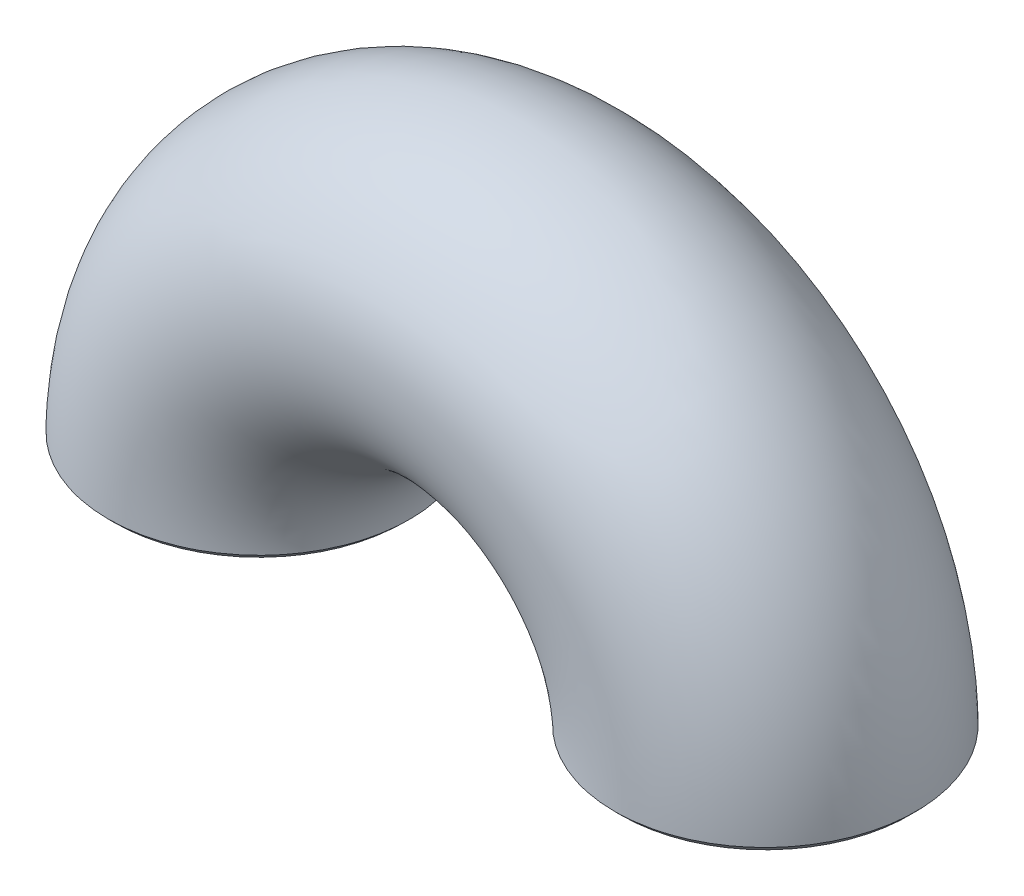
ISO-10303-21;
HEADER;
FILE_DESCRIPTION(('STEP AP214'),'2;1');
FILE_NAME('part.step','',(''),(''),'','','');
FILE_SCHEMA(('AUTOMOTIVE_DESIGN { 1 0 10303 214 1 1 1 1 }'));
ENDSEC;
DATA;
#1=APPLICATION_CONTEXT('core data for automotive mechanical design processes');
#2=APPLICATION_PROTOCOL_DEFINITION('international standard','automotive_design',2000,#1);
#3=PRODUCT_CONTEXT('',#1,'mechanical');
#4=PRODUCT('Part','Part','',(#3));
#5=PRODUCT_RELATED_PRODUCT_CATEGORY('part','',(#4));
#6=PRODUCT_DEFINITION_FORMATION('','',#4);
#7=PRODUCT_DEFINITION_CONTEXT('part definition',#1,'design');
#8=PRODUCT_DEFINITION('design','',#6,#7);
#9=PRODUCT_DEFINITION_SHAPE('','',#8);
#10=(LENGTH_UNIT() NAMED_UNIT(*) SI_UNIT(.MILLI.,.METRE.));
#11=(NAMED_UNIT(*) PLANE_ANGLE_UNIT() SI_UNIT($,.RADIAN.));
#12=(NAMED_UNIT(*) SI_UNIT($,.STERADIAN.) SOLID_ANGLE_UNIT());
#13=UNCERTAINTY_MEASURE_WITH_UNIT(LENGTH_MEASURE(1.E-05),#10,'distance_accuracy_value','');
#14=(GEOMETRIC_REPRESENTATION_CONTEXT(3) GLOBAL_UNCERTAINTY_ASSIGNED_CONTEXT((#13)) GLOBAL_UNIT_ASSIGNED_CONTEXT((#10,
#11,#12)) REPRESENTATION_CONTEXT('',''));
#15=CARTESIAN_POINT('',(0.,0.,0.));
#16=DIRECTION('',(0.,0.,1.));
#17=DIRECTION('',(1.,0.,0.));
#18=AXIS2_PLACEMENT_3D('',#15,#16,#17);
#19=CARTESIAN_POINT('',(0.,0.,0.));
#20=DIRECTION('',(0.,0.,1.));
#21=DIRECTION('',(1.,0.,0.));
#22=AXIS2_PLACEMENT_3D('',#19,#20,#21);
#23=TOROIDAL_SURFACE('',#22,50.8,30.1625);
#24=CARTESIAN_POINT('',(-50.8007556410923,1.30388606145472,30.1624949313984));
#25=CARTESIAN_POINT('',(-51.3102317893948,1.30445095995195,30.1623614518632));
#26=CARTESIAN_POINT('',(-51.8196736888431,1.30499934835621,30.1490523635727));
#27=CARTESIAN_POINT('',(-52.8398335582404,1.30606762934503,30.0964746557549));
#28=CARTESIAN_POINT('',(-53.3505447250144,1.30658736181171,30.0570735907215));
#29=CARTESIAN_POINT('',(-54.3693658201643,1.30759712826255,29.9527134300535));
#30=CARTESIAN_POINT('',(-54.877475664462,1.30808716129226,29.8877535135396));
#31=CARTESIAN_POINT('',(-55.8871747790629,1.30903580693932,29.732179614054));
#32=CARTESIAN_POINT('',(-56.3887839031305,1.3094945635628,29.641694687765));
#33=CARTESIAN_POINT('',(-57.3844184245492,1.31038289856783,29.4359304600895));
#34=CARTESIAN_POINT('',(-57.8784684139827,1.31081260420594,29.3207699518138));
#35=CARTESIAN_POINT('',(-58.8599170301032,1.31164625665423,29.0659071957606));
#36=CARTESIAN_POINT('',(-59.3473191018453,1.31205021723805,28.9262182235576));
#37=CARTESIAN_POINT('',(-60.31560392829,1.31283441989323,28.6219456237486));
#38=CARTESIAN_POINT('',(-60.7964677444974,1.31321460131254,28.4573017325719));
#39=CARTESIAN_POINT('',(-61.7518242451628,1.31395354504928,28.1031355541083));
#40=CARTESIAN_POINT('',(-62.2262700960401,1.31431218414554,27.9134869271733));
#41=CARTESIAN_POINT('',(-63.1659190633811,1.3150076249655,27.5097395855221));
#42=CARTESIAN_POINT('',(-63.631098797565,1.31534437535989,27.2955864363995));
#43=CARTESIAN_POINT('',(-64.5494211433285,1.31599578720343,26.8442190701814));
#44=CARTESIAN_POINT('',(-65.0025777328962,1.31631047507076,26.6070332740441));
#45=CARTESIAN_POINT('',(-65.8948485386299,1.31691823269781,26.1109034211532));
#46=CARTESIAN_POINT('',(-66.3340045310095,1.31721137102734,25.8520345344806));
#47=CARTESIAN_POINT('',(-67.1963761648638,1.3177765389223,25.3134855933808));
#48=CARTESIAN_POINT('',(-67.6196593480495,1.31804866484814,25.0339136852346));
#49=CARTESIAN_POINT('',(-68.4517645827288,1.31857456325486,24.4538490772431));
#50=CARTESIAN_POINT('',(-68.8605836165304,1.31882833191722,24.1533520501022));
#51=CARTESIAN_POINT('',(-69.6638045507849,1.31931880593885,23.5311868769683));
#52=CARTESIAN_POINT('',(-70.0581581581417,1.31955545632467,23.2094563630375));
#53=CARTESIAN_POINT('',(-70.8318331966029,1.32001256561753,22.5448863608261));
#54=CARTESIAN_POINT('',(-71.2110767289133,1.32023294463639,22.2019561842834));
#55=CARTESIAN_POINT('',(-71.9532450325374,1.32065802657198,21.4957618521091));
#56=CARTESIAN_POINT('',(-72.3160927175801,1.32086265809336,21.1324166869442));
#57=CARTESIAN_POINT('',(-73.0209275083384,1.32125484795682,20.3896766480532));
#58=CARTESIAN_POINT('',(-73.3630148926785,1.32144249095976,20.0103769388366));
#59=CARTESIAN_POINT('',(-74.0257790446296,1.32180137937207,19.2367431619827));
#60=CARTESIAN_POINT('',(-74.3465529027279,1.3219727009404,18.8424922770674));
#61=CARTESIAN_POINT('',(-74.966957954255,1.32230015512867,18.0393691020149));
#62=CARTESIAN_POINT('',(-75.2666429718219,1.32245632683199,17.6305383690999));
#63=CARTESIAN_POINT('',(-75.8455034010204,1.32275489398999,16.7980206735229));
#64=CARTESIAN_POINT('',(-76.1246590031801,1.32289727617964,16.3743199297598));
#65=CARTESIAN_POINT('',(-76.662524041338,1.32316893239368,15.5106294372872));
#66=CARTESIAN_POINT('',(-76.9211019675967,1.32329812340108,15.0705577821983));
#67=CARTESIAN_POINT('',(-77.4165832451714,1.32354346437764,14.1765868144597));
#68=CARTESIAN_POINT('',(-77.6534163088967,1.32365957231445,13.7226485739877));
#69=CARTESIAN_POINT('',(-78.1036969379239,1.3238785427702,12.8034721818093));
#70=CARTESIAN_POINT('',(-78.3171513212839,1.32398140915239,12.3382373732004));
#71=CARTESIAN_POINT('',(-78.7191023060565,1.32417381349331,11.3991871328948));
#72=CARTESIAN_POINT('',(-78.9076899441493,1.32426340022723,10.9254106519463));
#73=CARTESIAN_POINT('',(-79.2600640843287,1.32442981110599,9.97099853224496));
#74=CARTESIAN_POINT('',(-79.4239519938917,1.32450668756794,9.49040032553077));
#75=CARTESIAN_POINT('',(-79.7269195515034,1.32464803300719,8.5221374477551));
#76=CARTESIAN_POINT('',(-79.8660314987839,1.32471251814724,8.03448288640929));
#77=CARTESIAN_POINT('',(-80.1198260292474,1.3248296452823,7.05198391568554));
#78=CARTESIAN_POINT('',(-80.2344669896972,1.32488226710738,6.55712876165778));
#79=CARTESIAN_POINT('',(-80.4391092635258,1.32497596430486,5.55984191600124));
#80=CARTESIAN_POINT('',(-80.5289884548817,1.32501698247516,5.05738512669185));
#81=CARTESIAN_POINT('',(-80.6831873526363,1.32508719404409,4.0466592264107));
#82=CARTESIAN_POINT('',(-80.7474108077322,1.32511634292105,3.53837545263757));
#83=CARTESIAN_POINT('',(-80.8502233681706,1.32516290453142,2.51966294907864));
#84=CARTESIAN_POINT('',(-80.8888343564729,1.32518032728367,2.0092364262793));
#85=CARTESIAN_POINT('',(-80.9397341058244,1.32520325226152,0.989859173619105));
#86=CARTESIAN_POINT('',(-80.9521654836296,1.32520881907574,0.48091561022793));
#87=CARTESIAN_POINT('',(-80.9511182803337,1.32520834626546,-0.53452981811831));
#88=CARTESIAN_POINT('',(-80.9377619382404,1.3252023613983,-1.04103184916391));
#89=CARTESIAN_POINT('',(-80.885791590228,1.32517895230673,-2.05318299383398));
#90=CARTESIAN_POINT('',(-80.8471555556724,1.32516151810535,-2.55883097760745));
#91=CARTESIAN_POINT('',(-80.7441012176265,1.32511484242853,-3.56936018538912));
#92=CARTESIAN_POINT('',(-80.6795893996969,1.32508555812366,-4.07423188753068));
#93=CARTESIAN_POINT('',(-80.5246178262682,1.32501498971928,-5.08326761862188));
#94=CARTESIAN_POINT('',(-80.4339953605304,1.32497363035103,-5.58740664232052));
#95=CARTESIAN_POINT('',(-80.2271522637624,1.32487891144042,-6.59070603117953));
#96=CARTESIAN_POINT('',(-80.110917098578,1.32482554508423,-7.0898634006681));
#97=CARTESIAN_POINT('',(-79.853641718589,1.32470677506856,-8.07969841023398));
#98=CARTESIAN_POINT('',(-79.7126984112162,1.32464141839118,-8.57040124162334));
#99=CARTESIAN_POINT('',(-79.4066698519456,1.32449859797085,-9.54230113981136));
#100=CARTESIAN_POINT('',(-79.2416722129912,1.32442117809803,-10.023525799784));
#101=CARTESIAN_POINT('',(-78.8881431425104,1.32425413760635,-10.9755579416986));
#102=CARTESIAN_POINT('',(-78.6996861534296,1.32416455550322,-11.446393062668));
#103=CARTESIAN_POINT('',(-78.298776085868,1.32397255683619,-12.3788850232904));
#104=CARTESIAN_POINT('',(-78.0862743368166,1.32387011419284,-12.8405209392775));
#105=CARTESIAN_POINT('',(-77.6374281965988,1.32365176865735,-13.7541723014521));
#106=CARTESIAN_POINT('',(-77.4009984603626,1.32353581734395,-14.206145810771));
#107=CARTESIAN_POINT('',(-76.9047952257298,1.32329000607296,-15.0989848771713));
#108=CARTESIAN_POINT('',(-76.6449496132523,1.32316010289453,-15.5398103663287));
#109=CARTESIAN_POINT('',(-76.1025604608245,1.32288603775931,-16.4084883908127));
#110=CARTESIAN_POINT('',(-75.8199728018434,1.32274184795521,-16.8363133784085));
#111=CARTESIAN_POINT('',(-75.2349789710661,1.32243988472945,-17.6748410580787));
#112=CARTESIAN_POINT('',(-74.9326851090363,1.3222821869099,-18.0856221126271));
#113=CARTESIAN_POINT('',(-74.3090427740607,1.32195264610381,-18.8893873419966));
#114=CARTESIAN_POINT('',(-73.9877899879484,1.3217808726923,-19.2824457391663));
#115=CARTESIAN_POINT('',(-73.3264140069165,1.32142236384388,-20.0511272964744));
#116=CARTESIAN_POINT('',(-72.9863253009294,1.32123565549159,-20.4267801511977));
#117=CARTESIAN_POINT('',(-72.2872433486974,1.32084640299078,-21.1614223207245));
#118=CARTESIAN_POINT('',(-71.9282157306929,1.32064382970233,-21.5203789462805));
#119=CARTESIAN_POINT('',(-71.1897153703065,1.32022060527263,-22.2216854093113));
#120=CARTESIAN_POINT('',(-70.810122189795,1.31999984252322,-22.5639084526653));
#121=CARTESIAN_POINT('',(-70.033129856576,1.31954046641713,-23.229783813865));
#122=CARTESIAN_POINT('',(-69.6356832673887,1.31930180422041,-23.5533807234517));
#123=CARTESIAN_POINT('',(-68.8257967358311,1.31880690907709,-24.1794265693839));
#124=CARTESIAN_POINT('',(-68.4133903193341,1.31855071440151,-24.4819188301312));
#125=CARTESIAN_POINT('',(-67.5759235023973,1.31802073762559,-25.0634719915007));
#126=CARTESIAN_POINT('',(-67.1509504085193,1.31774706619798,-25.3426586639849));
#127=CARTESIAN_POINT('',(-66.2887818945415,1.31718125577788,-25.8787661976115));
#128=CARTESIAN_POINT('',(-65.851622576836,1.31688916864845,-26.1357451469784));
#129=CARTESIAN_POINT('',(-64.9646261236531,1.3162843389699,-26.6273784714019));
#130=CARTESIAN_POINT('',(-64.5147826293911,1.31597158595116,-26.8620213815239));
#131=CARTESIAN_POINT('',(-63.6022325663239,1.31532357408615,-27.3090936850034));
#132=CARTESIAN_POINT('',(-63.1394863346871,1.31498823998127,-27.5214420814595));
#133=CARTESIAN_POINT('',(-62.2016156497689,1.3142936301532,-27.9235010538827));
#134=CARTESIAN_POINT('',(-61.7264422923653,1.31393424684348,-28.1130976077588));
#135=CARTESIAN_POINT('',(-60.7666114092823,1.31319121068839,-28.4678597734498));
#136=CARTESIAN_POINT('',(-60.281946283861,1.31280753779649,-28.6330048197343));
#137=CARTESIAN_POINT('',(-59.3058470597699,1.31201610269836,-28.9383377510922));
#138=CARTESIAN_POINT('',(-58.8144278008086,1.31160838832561,-29.0785731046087));
#139=CARTESIAN_POINT('',(-57.8273769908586,1.31076875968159,-29.3333264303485));
#140=CARTESIAN_POINT('',(-57.3317753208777,1.31033696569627,-29.4479600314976));
#141=CARTESIAN_POINT('',(-56.3370483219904,1.30944751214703,-29.6513780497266));
#142=CARTESIAN_POINT('',(-55.8379406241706,1.3089899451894,-29.7402487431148));
#143=CARTESIAN_POINT('',(-54.8347433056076,1.30804558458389,-29.8930484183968));
#144=CARTESIAN_POINT('',(-54.3306448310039,1.3075587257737,-29.9569192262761));
#145=CARTESIAN_POINT('',(-53.3181811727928,1.30655368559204,-30.0593570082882));
#146=CARTESIAN_POINT('',(-52.8098073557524,1.30603540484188,-30.0978385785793));
#147=CARTESIAN_POINT('',(-51.7895696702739,1.30496616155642,-30.1494950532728));
#148=CARTESIAN_POINT('',(-51.2777002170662,1.30441506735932,-30.1625597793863));
#149=CARTESIAN_POINT('',(-50.2527496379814,1.30327823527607,-30.1624299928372));
#150=CARTESIAN_POINT('',(-49.7396684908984,1.30269241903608,-30.1491737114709));
#151=CARTESIAN_POINT('',(-48.7151134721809,1.30148535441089,-30.0960238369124));
#152=CARTESIAN_POINT('',(-48.2036390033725,1.30086412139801,-30.0561417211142));
#153=CARTESIAN_POINT('',(-47.1837890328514,1.29958638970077,-29.9504116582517));
#154=CARTESIAN_POINT('',(-46.6754114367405,1.29892991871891,-29.8845838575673));
#155=CARTESIAN_POINT('',(-45.6632534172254,1.29758127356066,-29.7273843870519));
#156=CARTESIAN_POINT('',(-45.1594681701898,1.29688914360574,-29.6360437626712));
#157=CARTESIAN_POINT('',(-44.1579922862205,1.2954688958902,-29.4283063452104));
#158=CARTESIAN_POINT('',(-43.6602926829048,1.29474084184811,-29.3119527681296));
#159=CARTESIAN_POINT('',(-42.6724902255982,1.2932484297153,-29.0546512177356));
#160=CARTESIAN_POINT('',(-42.1823727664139,1.29248415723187,-28.9137593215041));
#161=CARTESIAN_POINT('',(-41.2112277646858,1.29091894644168,-28.6078728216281));
#162=CARTESIAN_POINT('',(-40.7301785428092,1.29011811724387,-28.4429470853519));
#163=CARTESIAN_POINT('',(-39.7785545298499,1.28847937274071,-28.0893318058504));
#164=CARTESIAN_POINT('',(-39.3079523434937,1.28764157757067,-27.9007160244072));
#165=CARTESIAN_POINT('',(-38.3755525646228,1.28592209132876,-27.49917141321));
#166=CARTESIAN_POINT('',(-37.9137859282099,1.28504027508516,-27.286170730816));
#167=CARTESIAN_POINT('',(-36.9996290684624,1.28323306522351,-26.8362725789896));
#168=CARTESIAN_POINT('',(-36.5472866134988,1.28230750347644,-26.5992780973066));
#169=CARTESIAN_POINT('',(-35.6540086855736,1.28041535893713,-26.1021577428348));
#170=CARTESIAN_POINT('',(-35.2131045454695,1.2794486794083,-25.8419755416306));
#171=CARTESIAN_POINT('',(-34.3450400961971,1.27747724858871,-25.2993017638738));
#172=CARTESIAN_POINT('',(-33.9178844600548,1.27647248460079,-25.0168027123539));
#173=CARTESIAN_POINT('',(-33.0806335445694,1.27443205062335,-24.4320730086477));
#174=CARTESIAN_POINT('',(-32.6704605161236,1.27339657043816,-24.1299536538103));
#175=CARTESIAN_POINT('',(-31.8675859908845,1.27129818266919,-23.5065379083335));
#176=CARTESIAN_POINT('',(-31.474821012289,1.27023540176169,-23.185323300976));
#177=CARTESIAN_POINT('',(-30.7064157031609,1.26808401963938,-22.5238153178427));
#178=CARTESIAN_POINT('',(-30.3307581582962,1.26699544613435,-22.1835419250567));
#179=CARTESIAN_POINT('',(-29.5958673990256,1.26479294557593,-21.4838568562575));
#180=CARTESIAN_POINT('',(-29.2366785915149,1.2636789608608,-21.1243985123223));
#181=CARTESIAN_POINT('',(-28.5350313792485,1.26142685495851,-20.3851328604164));
#182=CARTESIAN_POINT('',(-28.1926942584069,1.26028862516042,-20.0052104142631));
#183=CARTESIAN_POINT('',(-27.526793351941,1.25800288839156,-19.2277875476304));
#184=CARTESIAN_POINT('',(-27.203273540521,1.25685536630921,-18.8302494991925));
#185=CARTESIAN_POINT('',(-26.5776052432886,1.25456623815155,-18.0204888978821));
#186=CARTESIAN_POINT('',(-26.2753984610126,1.25342462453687,-17.6083114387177));
#187=CARTESIAN_POINT('',(-25.6945564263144,1.25116051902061,-16.7715383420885));
#188=CARTESIAN_POINT('',(-25.4157840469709,1.25003795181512,-16.3470378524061));
#189=CARTESIAN_POINT('',(-24.8802150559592,1.24781964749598,-15.4855422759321));
#190=CARTESIAN_POINT('',(-24.6233768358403,1.24672386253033,-15.0485730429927));
#191=CARTESIAN_POINT('',(-24.1317869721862,1.24457035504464,-14.1615739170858));
#192=CARTESIAN_POINT('',(-23.8970667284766,1.24351268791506,-13.7115266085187));
#193=CARTESIAN_POINT('',(-23.4496949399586,1.24144626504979,-12.7981316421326));
#194=CARTESIAN_POINT('',(-23.2371454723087,1.24043774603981,-12.3347340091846));
#195=CARTESIAN_POINT('',(-22.8347701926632,1.23848402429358,-11.3955464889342));
#196=CARTESIAN_POINT('',(-22.6450579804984,1.23753914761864,-10.9197079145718));
#197=CARTESIAN_POINT('',(-22.2904053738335,1.23573759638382,-9.95938974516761));
#198=CARTESIAN_POINT('',(-22.1254421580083,1.23488084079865,-9.47491857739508));
#199=CARTESIAN_POINT('',(-21.8206524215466,1.233269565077,-8.49954020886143));
#200=CARTESIAN_POINT('',(-21.6807606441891,1.23251478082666,-8.00865339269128));
#201=CARTESIAN_POINT('',(-21.4266246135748,1.23112248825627,-7.02246131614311));
#202=CARTESIAN_POINT('',(-21.3122759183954,1.23048450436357,-6.52718299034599));
#203=CARTESIAN_POINT('',(-21.109167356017,1.22933948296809,-5.53268223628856));
#204=CARTESIAN_POINT('',(-21.0203450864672,1.22883212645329,-5.03347254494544));
#205=CARTESIAN_POINT('',(-20.8676522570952,1.22795353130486,-4.0298895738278));
#206=CARTESIAN_POINT('',(-20.8038489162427,1.22758265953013,-3.52550606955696));
#207=CARTESIAN_POINT('',(-20.7016733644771,1.22698436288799,-2.51223643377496));
#208=CARTESIAN_POINT('',(-20.6633983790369,1.22675748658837,-2.0033404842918));
#209=CARTESIAN_POINT('',(-20.6126630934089,1.22645503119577,-0.981760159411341));
#210=CARTESIAN_POINT('',(-20.600330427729,1.22638020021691,-0.469069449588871));
#211=CARTESIAN_POINT('',(-20.6017894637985,1.22638883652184,0.555688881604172));
#212=CARTESIAN_POINT('',(-20.6155513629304,1.22647212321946,1.06775654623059));
#213=CARTESIAN_POINT('',(-20.6690415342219,1.22679067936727,2.08734481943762));
#214=CARTESIAN_POINT('',(-20.7086078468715,1.22702500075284,2.59487390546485));
#215=CARTESIAN_POINT('',(-20.8133424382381,1.22763777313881,3.60539861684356));
#216=CARTESIAN_POINT('',(-20.8784164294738,1.22801569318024,4.10840403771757));
#217=CARTESIAN_POINT('',(-21.0334775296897,1.22890719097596,5.10999700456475));
#218=CARTESIAN_POINT('',(-21.1234372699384,1.22942061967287,5.60858878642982));
#219=CARTESIAN_POINT('',(-21.3291457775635,1.23057884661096,6.60301883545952));
#220=CARTESIAN_POINT('',(-21.4450206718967,1.23122428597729,7.09883104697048));
#221=CARTESIAN_POINT('',(-21.7023948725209,1.23263176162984,8.08637135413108));
#222=CARTESIAN_POINT('',(-21.8440182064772,1.23339435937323,8.57806707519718));
#223=CARTESIAN_POINT('',(-22.1519607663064,1.23501905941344,9.55419744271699));
#224=CARTESIAN_POINT('',(-22.3183040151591,1.23588125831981,10.038624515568));
#225=CARTESIAN_POINT('',(-22.6751840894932,1.23768992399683,10.9968761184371));
#226=CARTESIAN_POINT('',(-22.8656488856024,1.23863613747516,11.4707274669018));
#227=CARTESIAN_POINT('',(-23.2693464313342,1.24059140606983,12.4059803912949));
#228=CARTESIAN_POINT('',(-23.4824679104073,1.24160014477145,12.8674300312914));
#229=CARTESIAN_POINT('',(-23.9312292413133,1.24366790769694,13.7779562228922));
#230=CARTESIAN_POINT('',(-24.166817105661,1.24472681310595,14.2270583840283));
#231=CARTESIAN_POINT('',(-24.6606081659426,1.24688425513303,15.113082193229));
#232=CARTESIAN_POINT('',(-24.9188279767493,1.24798282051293,15.5499945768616));
#233=CARTESIAN_POINT('',(-25.4577532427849,1.25020832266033,16.4120049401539));
#234=CARTESIAN_POINT('',(-25.7385392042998,1.25133535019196,16.8370526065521));
#235=CARTESIAN_POINT('',(-26.3229082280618,1.25360577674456,17.6740909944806));
#236=CARTESIAN_POINT('',(-26.6265901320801,1.25474922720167,18.0860127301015));
#237=CARTESIAN_POINT('',(-27.2546290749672,1.257039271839,18.8943612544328));
#238=CARTESIAN_POINT('',(-27.5790044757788,1.25818586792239,19.2907737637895));
#239=CARTESIAN_POINT('',(-28.2462137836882,1.26046804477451,20.0654593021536));
#240=CARTESIAN_POINT('',(-28.5889824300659,1.26160364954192,20.443788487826));
#241=CARTESIAN_POINT('',(-29.2913241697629,1.26385010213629,21.1798946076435));
#242=CARTESIAN_POINT('',(-29.650775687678,1.2649610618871,21.5377875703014));
#243=CARTESIAN_POINT('',(-30.3866612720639,1.26715906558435,22.2349127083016));
#244=CARTESIAN_POINT('',(-30.7630783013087,1.26824613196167,22.5741628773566));
#245=CARTESIAN_POINT('',(-31.5335145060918,1.27039589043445,23.234093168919));
#246=CARTESIAN_POINT('',(-31.9275757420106,1.27145851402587,23.5547242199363));
#247=CARTESIAN_POINT('',(-32.7335235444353,1.27355753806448,24.1772300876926));
#248=CARTESIAN_POINT('',(-33.1454922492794,1.27459377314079,24.4789985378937));
#249=CARTESIAN_POINT('',(-33.9862832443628,1.27663510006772,25.062787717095));
#250=CARTESIAN_POINT('',(-34.4151801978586,1.27764000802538,25.3447009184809));
#251=CARTESIAN_POINT('',(-35.2851542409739,1.2796079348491,25.8852520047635));
#252=CARTESIAN_POINT('',(-35.726179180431,1.28057109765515,26.1439738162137));
#253=CARTESIAN_POINT('',(-36.6190210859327,1.28245476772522,26.6377057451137));
#254=CARTESIAN_POINT('',(-37.0707882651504,1.28337542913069,26.8728059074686));
#255=CARTESIAN_POINT('',(-37.9841275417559,1.2851743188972,27.3191822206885));
#256=CARTESIAN_POINT('',(-38.4456630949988,1.28605267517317,27.530533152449));
#257=CARTESIAN_POINT('',(-39.3785304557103,1.28776872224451,27.9296074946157));
#258=CARTESIAN_POINT('',(-39.8498565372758,1.28860643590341,28.1173442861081));
#259=CARTESIAN_POINT('',(-40.8033674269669,1.29024563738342,28.4694513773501));
#260=CARTESIAN_POINT('',(-41.2855890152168,1.29104696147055,28.6337220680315));
#261=CARTESIAN_POINT('',(-42.2593135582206,1.29261322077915,28.9382727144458));
#262=CARTESIAN_POINT('',(-42.7508420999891,1.29337802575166,29.0784708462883));
#263=CARTESIAN_POINT('',(-43.7415502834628,1.29487060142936,29.3340344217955));
#264=CARTESIAN_POINT('',(-44.2407452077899,1.29559828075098,29.4493406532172));
#265=CARTESIAN_POINT('',(-45.2434245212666,1.29701414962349,29.6541664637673));
#266=CARTESIAN_POINT('',(-45.7468991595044,1.2977024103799,29.7437337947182));
#267=CARTESIAN_POINT('',(-46.754827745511,1.29903861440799,29.8967835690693));
#268=CARTESIAN_POINT('',(-47.2592592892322,1.29968676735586,29.9604135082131));
#269=CARTESIAN_POINT('',(-48.2692364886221,1.30094600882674,30.0618432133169));
#270=CARTESIAN_POINT('',(-48.7747747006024,1.30155719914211,30.0997171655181));
#271=CARTESIAN_POINT('',(-49.7871326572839,1.30274623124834,30.1500945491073));
#272=CARTESIAN_POINT('',(-50.2939524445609,1.30332407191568,30.1625971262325));
#273=CARTESIAN_POINT('',(-50.8007556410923,1.30388606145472,30.1624949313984));
#274=B_SPLINE_CURVE_WITH_KNOTS('',3,(#24,#25,#26,#27,#28,#29,#30,#31,#32,#33,#34,#35,#36,#37,
#38,#39,#40,#41,#42,#43,#44,#45,#46,#47,#48,#49,#50,#51,#52,#53,#54,#55,#56,#57,#58,#59,#60,#61,
#62,#63,#64,#65,#66,#67,#68,#69,#70,#71,#72,#73,#74,#75,#76,#77,#78,#79,#80,#81,#82,#83,#84,#85,
#86,#87,#88,#89,#90,#91,#92,#93,#94,#95,#96,#97,#98,#99,#100,#101,#102,#103,#104,#105,#106,#107,
#108,#109,#110,#111,#112,#113,#114,#115,#116,#117,#118,#119,#120,#121,#122,#123,#124,#125,#126,
#127,#128,#129,#130,#131,#132,#133,#134,#135,#136,#137,#138,#139,#140,#141,#142,#143,#144,#145,
#146,#147,#148,#149,#150,#151,#152,#153,#154,#155,#156,#157,#158,#159,#160,#161,#162,#163,#164,
#165,#166,#167,#168,#169,#170,#171,#172,#173,#174,#175,#176,#177,#178,#179,#180,#181,#182,#183,
#184,#185,#186,#187,#188,#189,#190,#191,#192,#193,#194,#195,#196,#197,#198,#199,#200,#201,#202,
#203,#204,#205,#206,#207,#208,#209,#210,#211,#212,#213,#214,#215,#216,#217,#218,#219,#220,#221,
#222,#223,#224,#225,#226,#227,#228,#229,#230,#231,#232,#233,#234,#235,#236,#237,#238,#239,#240,
#241,#242,#243,#244,#245,#246,#247,#248,#249,#250,#251,#252,#253,#254,#255,#256,#257,#258,#259,
#260,#261,#262,#263,#264,#265,#266,#267,#268,#269,#270,#271,#272,#273),.UNSPECIFIED.,.F.,.F.,(4,
2,2,2,2,2,2,2,2,2,2,2,2,2,2,2,2,2,2,2,2,2,2,2,2,2,2,2,2,2,2,2,2,2,2,2,2,2,2,2,2,2,2,2,2,2,2,2,2,
2,2,2,2,2,2,2,2,2,2,2,2,2,2,2,2,2,2,2,2,2,2,2,2,2,2,2,2,2,2,2,2,2,2,2,2,2,2,2,2,2,2,2,2,2,2,2,2,
2,2,2,2,2,2,2,2,2,2,2,2,2,2,2,2,2,2,2,2,2,2,2,2,2,2,2,4),(0.,1.52821238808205,3.06424221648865,
4.60032138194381,6.12876907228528,7.65001751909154,9.17044514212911,10.6946047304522,
12.2267836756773,13.7624348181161,15.2962145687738,16.8248812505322,18.3460603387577,
19.8675549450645,21.3937366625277,22.9269720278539,24.466792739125,25.9984605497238,
27.5225899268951,29.0426765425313,30.5642111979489,32.0947972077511,33.6301682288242,
35.165090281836,36.6942270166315,38.2169038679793,39.7375809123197,41.2608242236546,
42.791450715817,44.3277668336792,45.8627686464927,47.3893864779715,48.9087855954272,
50.4295104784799,51.9557814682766,53.4917772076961,55.0286468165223,56.5596183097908,
58.0851467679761,59.6059521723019,61.1298929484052,62.6594747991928,64.1939397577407,
65.7314568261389,67.2608699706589,68.7831331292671,70.302695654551,71.8251178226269,
73.3576986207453,74.8946250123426,76.4282973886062,77.95307093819,79.4737271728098,
80.9951597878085,82.5219413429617,84.0560804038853,85.5915025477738,87.1239666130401,
88.6493627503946,90.1695899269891,91.6933338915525,93.2221776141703,94.7576340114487,
96.2966979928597,97.8350989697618,99.3723077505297,100.907654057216,102.440368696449,
103.96962553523,105.494583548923,107.014905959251,108.539829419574,110.071185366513,
111.606368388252,113.142067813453,114.669710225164,116.191225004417,117.711173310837,
119.235004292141,120.76855183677,122.305549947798,123.838166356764,125.361079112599,
126.881035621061,128.403118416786,129.931925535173,131.468048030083,133.002745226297,
134.533387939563,136.057652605,137.578158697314,139.102722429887,140.633059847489,
142.170908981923,143.70700279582,145.233547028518,146.754500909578,148.273788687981,
149.800638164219,151.33504717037,152.870957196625,154.402384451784,155.92661064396,
157.447391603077,158.969298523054,160.496898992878,162.031520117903,163.567522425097,
165.098395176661,166.619471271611,168.1390524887,169.662472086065,171.193824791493,
172.732917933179,174.266195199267,175.793386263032,177.315625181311,178.836997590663,
180.364647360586,181.897391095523,183.433741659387,184.967223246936,186.491858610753,
188.012083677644,189.532359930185),.UNSPECIFIED.);
#275=CARTESIAN_POINT('',(-50.8007556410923,1.30388606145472,30.1624949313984));
#276=VERTEX_POINT('',#275);
#277=EDGE_CURVE('E51',#276,#276,#274,.F.);
#278=ORIENTED_EDGE('',*,*,#277,.T.);
#279=EDGE_LOOP('',(#278));
#280=FACE_BOUND('',#279,.T.);
#281=CARTESIAN_POINT('',(50.8007556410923,1.30388606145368,30.1624949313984));
#282=CARTESIAN_POINT('',(50.2913845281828,1.30332168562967,30.1629530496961));
#283=CARTESIAN_POINT('',(49.7820323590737,1.30274071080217,30.1502411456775));
#284=CARTESIAN_POINT('',(48.761969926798,1.30154171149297,30.0988685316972));
#285=CARTESIAN_POINT('',(48.2512664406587,1.30092350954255,30.0600727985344));
#286=CARTESIAN_POINT('',(47.2323589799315,1.29965196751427,29.9569204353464));
#287=CARTESIAN_POINT('',(46.7241554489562,1.29899862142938,29.8925594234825));
#288=CARTESIAN_POINT('',(45.7141472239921,1.29765804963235,29.7381738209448));
#289=CARTESIAN_POINT('',(45.212323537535,1.29697100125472,29.648273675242));
#290=CARTESIAN_POINT('',(44.2162502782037,1.2955625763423,29.4436692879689));
#291=CARTESIAN_POINT('',(43.7219760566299,1.29484137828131,29.329084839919));
#292=CARTESIAN_POINT('',(42.7401466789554,1.29336147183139,29.0753908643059));
#293=CARTESIAN_POINT('',(42.2525868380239,1.29260279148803,28.9362994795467));
#294=CARTESIAN_POINT('',(41.2840536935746,1.29104460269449,28.6332636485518));
#295=CARTESIAN_POINT('',(40.8030976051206,1.29024500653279,28.469264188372));
#296=CARTESIAN_POINT('',(39.8476072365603,1.28860243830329,28.1164546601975));
#297=CARTESIAN_POINT('',(39.3731177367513,1.28775926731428,27.9275233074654));
#298=CARTESIAN_POINT('',(38.4331933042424,1.28602965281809,27.5251537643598));
#299=CARTESIAN_POINT('',(37.9677848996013,1.28514310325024,27.3116535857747));
#300=CARTESIAN_POINT('',(37.0488171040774,1.28333094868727,26.8615369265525));
#301=CARTESIAN_POINT('',(36.595247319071,1.28240537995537,26.6249416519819));
#302=CARTESIAN_POINT('',(35.7020901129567,1.28051874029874,26.1299887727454));
#303=CARTESIAN_POINT('',(35.262461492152,1.27955779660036,25.8717055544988));
#304=CARTESIAN_POINT('',(34.3992218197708,1.27760292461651,25.3343546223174));
#305=CARTESIAN_POINT('',(33.9755402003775,1.27660919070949,25.0554002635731));
#306=CARTESIAN_POINT('',(33.1426891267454,1.27458605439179,24.4766601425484));
#307=CARTESIAN_POINT('',(32.7335189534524,1.27355665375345,24.1768754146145));
#308=CARTESIAN_POINT('',(31.9295748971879,1.27146332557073,23.5561646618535));
#309=CARTESIAN_POINT('',(31.534847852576,1.27039930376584,23.2351779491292));
#310=CARTESIAN_POINT('',(30.7603358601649,1.2682388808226,22.572063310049));
#311=CARTESIAN_POINT('',(30.3806301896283,1.26714235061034,22.2298427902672));
#312=CARTESIAN_POINT('',(29.6373808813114,1.26492079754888,21.5249827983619));
#313=CARTESIAN_POINT('',(29.2739186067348,1.26379566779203,21.1622575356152));
#314=CARTESIAN_POINT('',(28.5677461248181,1.26153404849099,20.4206602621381));
#315=CARTESIAN_POINT('',(28.2249395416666,1.2603976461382,20.0418800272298));
#316=CARTESIAN_POINT('',(27.5606815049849,1.25812311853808,19.2692412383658));
#317=CARTESIAN_POINT('',(27.2391341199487,1.25698502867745,18.8754651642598));
#318=CARTESIAN_POINT('',(26.6171798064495,1.25471416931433,18.0732965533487));
#319=CARTESIAN_POINT('',(26.3167172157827,1.25358139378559,17.6649471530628));
#320=CARTESIAN_POINT('',(25.7363479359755,1.25132606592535,16.8334469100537));
#321=CARTESIAN_POINT('',(25.4564562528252,1.25020352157,16.4102855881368));
#322=CARTESIAN_POINT('',(24.917109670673,1.24797656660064,15.5477310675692));
#323=CARTESIAN_POINT('',(24.657782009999,1.24687229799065,15.108258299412));
#324=CARTESIAN_POINT('',(24.1607594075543,1.24469934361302,14.2154237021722));
#325=CARTESIAN_POINT('',(23.9231358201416,1.24363078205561,13.7620221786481));
#326=CARTESIAN_POINT('',(23.4711829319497,1.2415471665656,12.8437462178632));
#327=CARTESIAN_POINT('',(23.2568535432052,1.24053211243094,12.3788718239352));
#328=CARTESIAN_POINT('',(22.8530683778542,1.23857435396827,11.440368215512));
#329=CARTESIAN_POINT('',(22.6635284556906,1.2376314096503,10.9667751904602));
#330=CARTESIAN_POINT('',(22.3093121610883,1.23583460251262,10.0127622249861));
#331=CARTESIAN_POINT('',(22.1445296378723,1.23498036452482,9.53238169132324));
#332=CARTESIAN_POINT('',(21.839815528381,1.23337226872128,8.56460071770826));
#333=CARTESIAN_POINT('',(21.6998466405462,1.23261826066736,8.07721202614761));
#334=CARTESIAN_POINT('',(21.4443605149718,1.23122067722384,7.09529146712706));
#335=CARTESIAN_POINT('',(21.3288802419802,1.23057726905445,6.60074998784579));
#336=CARTESIAN_POINT('',(21.1225568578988,1.22941564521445,5.60404281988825));
#337=CARTESIAN_POINT('',(21.0318360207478,1.22889805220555,5.10185177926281));
#338=CARTESIAN_POINT('',(20.875951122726,1.22800195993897,4.09149405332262));
#339=CARTESIAN_POINT('',(20.8108893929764,1.22762401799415,3.58331160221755));
#340=CARTESIAN_POINT('',(20.7064128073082,1.22701252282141,2.56469609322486));
#341=CARTESIAN_POINT('',(20.6669791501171,1.22677886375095,2.05426496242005));
#342=CARTESIAN_POINT('',(20.6144767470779,1.22646589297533,1.03482967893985));
#343=CARTESIAN_POINT('',(20.601265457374,1.22638574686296,0.525832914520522));
#344=CARTESIAN_POINT('',(20.6008026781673,1.22638298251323,-0.48970250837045));
#345=CARTESIAN_POINT('',(20.6134259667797,1.2264596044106,-0.99624115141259));
#346=CARTESIAN_POINT('',(20.663958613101,1.22676101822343,-2.00843554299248));
#347=CARTESIAN_POINT('',(20.701886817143,1.22698592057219,-2.51409035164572));
#348=CARTESIAN_POINT('',(20.8035498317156,1.22758120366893,-3.5246213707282));
#349=CARTESIAN_POINT('',(20.8673760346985,1.22795209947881,-4.02948840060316));
#350=CARTESIAN_POINT('',(21.0209869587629,1.228835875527,-5.03852345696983));
#351=CARTESIAN_POINT('',(21.1109333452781,1.22934963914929,-5.54266685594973));
#352=CARTESIAN_POINT('',(21.3164707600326,1.23050800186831,-6.54609764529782));
#353=CARTESIAN_POINT('',(21.4320811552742,1.2311526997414,-7.04538106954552));
#354=CARTESIAN_POINT('',(21.688156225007,1.23255463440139,-8.03558901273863));
#355=CARTESIAN_POINT('',(21.8285287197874,1.233311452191,-8.52653737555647));
#356=CARTESIAN_POINT('',(22.1334408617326,1.23492230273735,-9.49895984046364));
#357=CARTESIAN_POINT('',(22.2978931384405,1.23577598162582,-9.98046134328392));
#358=CARTESIAN_POINT('',(22.6503559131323,1.2375655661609,-10.9329789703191));
#359=CARTESIAN_POINT('',(22.8382878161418,1.23850119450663,-11.4040241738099));
#360=CARTESIAN_POINT('',(23.2380943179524,1.24044216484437,-12.336854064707));
#361=CARTESIAN_POINT('',(23.4500117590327,1.24144763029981,-12.798620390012));
#362=CARTESIAN_POINT('',(23.8976726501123,1.2435156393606,-13.7125353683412));
#363=CARTESIAN_POINT('',(24.133499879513,1.244578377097,-14.1646429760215));
#364=CARTESIAN_POINT('',(24.6285411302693,1.24674698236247,-15.0578478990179));
#365=CARTESIAN_POINT('',(24.8878307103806,1.24785298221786,-15.4989033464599));
#366=CARTESIAN_POINT('',(25.429186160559,1.2500929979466,-16.3682243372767));
#367=CARTESIAN_POINT('',(25.7113033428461,1.25122707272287,-16.7964579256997));
#368=CARTESIAN_POINT('',(26.2953795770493,1.25350064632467,-17.6358337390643));
#369=CARTESIAN_POINT('',(26.5972265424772,1.25464008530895,-18.0470539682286));
#370=CARTESIAN_POINT('',(27.2199556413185,1.25691606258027,-18.851676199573));
#371=CARTESIAN_POINT('',(27.5407396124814,1.25805258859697,-19.2451541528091));
#372=CARTESIAN_POINT('',(28.2011373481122,1.26031662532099,-20.01465133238));
#373=CARTESIAN_POINT('',(28.5407136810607,1.2614441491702,-20.3907027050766));
#374=CARTESIAN_POINT('',(29.2387183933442,1.26368465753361,-21.1261248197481));
#375=CARTESIAN_POINT('',(29.5971782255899,1.26479761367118,-21.4854657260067));
#376=CARTESIAN_POINT('',(30.3345393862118,1.26700760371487,-22.187600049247));
#377=CARTESIAN_POINT('',(30.7135612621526,1.26810448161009,-22.5302669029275));
#378=CARTESIAN_POINT('',(31.4894641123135,1.27027440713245,-23.1971176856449));
#379=CARTESIAN_POINT('',(31.8863945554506,1.27134737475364,-23.521243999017));
#380=CARTESIAN_POINT('',(32.6953498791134,1.27345966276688,-24.1484593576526));
#381=CARTESIAN_POINT('',(33.1073446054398,1.27449904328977,-24.4515872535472));
#382=CARTESIAN_POINT('',(33.9440887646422,1.2765349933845,-25.0345144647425));
#383=CARTESIAN_POINT('',(34.3687537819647,1.27753177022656,-25.3144349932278));
#384=CARTESIAN_POINT('',(35.2302647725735,1.27948559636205,-25.8519769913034));
#385=CARTESIAN_POINT('',(35.6670721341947,1.28044275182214,-26.1096603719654));
#386=CARTESIAN_POINT('',(36.5532914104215,1.28231899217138,-26.6026799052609));
#387=CARTESIAN_POINT('',(37.0027068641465,1.28323806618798,-26.8380097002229));
#388=CARTESIAN_POINT('',(37.9143132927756,1.28503987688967,-27.2864542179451));
#389=CARTESIAN_POINT('',(38.3765413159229,1.28592248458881,-27.4994935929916));
#390=CARTESIAN_POINT('',(39.3133933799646,1.28765153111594,-27.9029881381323));
#391=CARTESIAN_POINT('',(39.788066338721,1.28849777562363,-28.0933297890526));
#392=CARTESIAN_POINT('',(40.7471367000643,1.29015097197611,-28.4496929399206));
#393=CARTESIAN_POINT('',(41.2315456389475,1.29095787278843,-28.6156833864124));
#394=CARTESIAN_POINT('',(42.2072566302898,1.29253101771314,-28.9227756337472));
#395=CARTESIAN_POINT('',(42.6985451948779,1.29329733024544,-29.0639203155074));
#396=CARTESIAN_POINT('',(43.6853376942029,1.29478762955,-29.3204886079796));
#397=CARTESIAN_POINT('',(44.1808109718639,1.29551179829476,-29.4360299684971));
#398=CARTESIAN_POINT('',(45.1752169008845,1.29691955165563,-29.6412326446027));
#399=CARTESIAN_POINT('',(45.6741305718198,1.29760327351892,-29.7309860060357));
#400=CARTESIAN_POINT('',(46.6769215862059,1.29893647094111,-29.885580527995));
#401=CARTESIAN_POINT('',(47.1808074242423,1.29958586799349,-29.9503665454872));
#402=CARTESIAN_POINT('',(48.1928478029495,1.30085177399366,-30.0546473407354));
#403=CARTESIAN_POINT('',(48.701010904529,1.30146816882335,-30.0940589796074));
#404=CARTESIAN_POINT('',(49.7208447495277,1.30266971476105,-30.1475881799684));
#405=CARTESIAN_POINT('',(50.2325212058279,1.30325472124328,-30.161597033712));
#406=CARTESIAN_POINT('',(51.2571884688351,1.30439334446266,-30.1633546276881));
#407=CARTESIAN_POINT('',(51.7701794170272,1.30494688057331,-30.1510387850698));
#408=CARTESIAN_POINT('',(52.7947099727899,1.30602213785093,-30.0997648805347));
#409=CARTESIAN_POINT('',(53.3062498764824,1.30654386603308,-30.0608127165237));
#410=CARTESIAN_POINT('',(54.3263562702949,1.30755671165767,-29.9569337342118));
#411=CARTESIAN_POINT('',(54.8349244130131,1.3080478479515,-29.8920230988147));
#412=CARTESIAN_POINT('',(55.8475588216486,1.30900068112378,-29.7366434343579));
#413=CARTESIAN_POINT('',(56.3516294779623,1.30946241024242,-29.646203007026));
#414=CARTESIAN_POINT('',(57.3537410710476,1.31035760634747,-29.44024650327));
#415=CARTESIAN_POINT('',(57.851790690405,1.3107911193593,-29.3247726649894));
#416=CARTESIAN_POINT('',(58.8403272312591,1.31163106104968,-29.0692053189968));
#417=CARTESIAN_POINT('',(59.3308287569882,1.31203754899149,-28.9291683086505));
#418=CARTESIAN_POINT('',(60.3027461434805,1.31282460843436,-28.6249634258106));
#419=CARTESIAN_POINT('',(60.7841840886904,1.31320525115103,-28.4608661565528));
#420=CARTESIAN_POINT('',(61.7365537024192,1.31394194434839,-28.1088673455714));
#421=CARTESIAN_POINT('',(62.2075137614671,1.31429806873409,-27.9210426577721));
#422=CARTESIAN_POINT('',(63.1405722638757,1.31498898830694,-27.5210831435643));
#423=CARTESIAN_POINT('',(63.6026418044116,1.31532372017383,-27.3088809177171));
#424=CARTESIAN_POINT('',(64.5174102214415,1.3159731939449,-26.8605514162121));
#425=CARTESIAN_POINT('',(64.9700619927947,1.31628784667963,-26.6243280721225));
#426=CARTESIAN_POINT('',(65.8640500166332,1.31689742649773,-26.1286695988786));
#427=CARTESIAN_POINT('',(66.3053530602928,1.31719229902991,-25.8691745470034));
#428=CARTESIAN_POINT('',(67.1743827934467,1.31776232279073,-25.3277683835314));
#429=CARTESIAN_POINT('',(67.6021005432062,1.31803746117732,-25.0458429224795));
#430=CARTESIAN_POINT('',(68.4404673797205,1.31856757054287,-24.4622089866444));
#431=CARTESIAN_POINT('',(68.8511946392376,1.3188226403,-24.1606127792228));
#432=CARTESIAN_POINT('',(69.655120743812,1.31931367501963,-23.5382319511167));
#433=CARTESIAN_POINT('',(70.0483853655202,1.31954971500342,-23.2175323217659));
#434=CARTESIAN_POINT('',(70.8177399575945,1.32000433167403,-22.5570593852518));
#435=CARTESIAN_POINT('',(71.193849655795,1.3202229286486,-22.2173090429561));
#436=CARTESIAN_POINT('',(71.9296154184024,1.3206445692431,-21.5186787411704));
#437=CARTESIAN_POINT('',(72.2892292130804,1.32084757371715,-21.1597542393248));
#438=CARTESIAN_POINT('',(72.9917726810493,1.32123878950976,-20.4214877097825));
#439=CARTESIAN_POINT('',(73.3345793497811,1.32142689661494,-20.0420286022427));
#440=CARTESIAN_POINT('',(74.0014702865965,1.32178822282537,-19.2654511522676));
#441=CARTESIAN_POINT('',(74.325508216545,1.32196140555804,-18.8682930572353));
#442=CARTESIAN_POINT('',(74.9522526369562,1.32229243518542,-18.0592084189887));
#443=CARTESIAN_POINT('',(75.2550150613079,1.32245032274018,-17.6473252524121));
#444=CARTESIAN_POINT('',(75.8369818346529,1.32275056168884,-16.8110772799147));
#445=CARTESIAN_POINT('',(76.1163220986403,1.32289300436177,-16.3868070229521));
#446=CARTESIAN_POINT('',(76.6529783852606,1.32316406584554,-15.5257972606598));
#447=CARTESIAN_POINT('',(76.9103392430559,1.3232927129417,-15.0890856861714));
#448=CARTESIAN_POINT('',(77.4029401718,1.32353673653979,-14.2026471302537));
#449=CARTESIAN_POINT('',(77.63815262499,1.32365209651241,-13.7529047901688));
#450=CARTESIAN_POINT('',(78.0864955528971,1.3238702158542,-12.8401768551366));
#451=CARTESIAN_POINT('',(78.2995279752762,1.32397291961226,-12.3771431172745));
#452=CARTESIAN_POINT('',(78.7029037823,1.32416609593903,-11.438654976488));
#453=CARTESIAN_POINT('',(78.8931332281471,1.32425650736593,-10.9631515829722));
#454=CARTESIAN_POINT('',(79.2489058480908,1.32442458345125,-10.0033031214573));
#455=CARTESIAN_POINT('',(79.414462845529,1.32450225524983,-9.51896317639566));
#456=CARTESIAN_POINT('',(79.720493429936,1.32464504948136,-8.54375407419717));
#457=CARTESIAN_POINT('',(79.8610286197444,1.3247102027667,-8.05290424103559));
#458=CARTESIAN_POINT('',(80.1164438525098,1.32482808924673,-7.06680396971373));
#459=CARTESIAN_POINT('',(80.2314308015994,1.32488087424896,-6.57158124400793));
#460=CARTESIAN_POINT('',(80.4357956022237,1.32497444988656,-5.57730474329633));
#461=CARTESIAN_POINT('',(80.525243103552,1.32501527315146,-5.07826527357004));
#462=CARTESIAN_POINT('',(80.6792342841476,1.32508539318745,-4.07508903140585));
#463=CARTESIAN_POINT('',(80.7437154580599,1.32511466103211,-3.57094266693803));
#464=CARTESIAN_POINT('',(80.8472844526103,1.32516156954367,-2.55810147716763));
#465=CARTESIAN_POINT('',(80.8862744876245,1.32517916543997,-2.0493966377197));
#466=CARTESIAN_POINT('',(80.9384972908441,1.32520269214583,-1.02804490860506));
#467=CARTESIAN_POINT('',(80.951596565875,1.32520856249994,-0.515391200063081));
#468=CARTESIAN_POINT('',(80.9517104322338,1.32520861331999,0.509460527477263));
#469=CARTESIAN_POINT('',(80.9387483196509,1.3252028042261,1.0216585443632));
#470=CARTESIAN_POINT('',(80.886868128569,1.32517943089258,2.041577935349));
#471=CARTESIAN_POINT('',(80.8481104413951,1.32516193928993,2.54930744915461));
#472=CARTESIAN_POINT('',(80.7450132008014,1.32511524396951,3.56025000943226));
#473=CARTESIAN_POINT('',(80.6807692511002,1.32508608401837,4.06347282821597));
#474=CARTESIAN_POINT('',(80.527378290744,1.32501624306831,5.06546050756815));
#475=CARTESIAN_POINT('',(80.4382627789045,1.32497557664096,5.56423018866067));
#476=CARTESIAN_POINT('',(80.2342923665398,1.32488218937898,6.55896273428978));
#477=CARTESIAN_POINT('',(80.1193168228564,1.32482941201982,7.05490089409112));
#478=CARTESIAN_POINT('',(79.8637647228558,1.32471146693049,8.04272898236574));
#479=CARTESIAN_POINT('',(79.7230650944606,1.3246462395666,8.53458702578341));
#480=CARTESIAN_POINT('',(79.416936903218,1.32450341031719,9.51118192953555));
#481=CARTESIAN_POINT('',(79.2514796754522,1.32442579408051,9.99590981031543));
#482=CARTESIAN_POINT('',(78.896308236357,1.32425801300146,10.955003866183));
#483=CARTESIAN_POINT('',(78.7066564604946,1.32416788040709,11.4293931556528));
#484=CARTESIAN_POINT('',(78.3045499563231,1.32397533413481,12.3657447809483));
#485=CARTESIAN_POINT('',(78.0922072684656,1.3238729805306,12.8277552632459));
#486=CARTESIAN_POINT('',(77.6450095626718,1.32365546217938,13.7393247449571));
#487=CARTESIAN_POINT('',(77.4102120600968,1.32354033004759,14.1889119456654));
#488=CARTESIAN_POINT('',(76.9180269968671,1.32329656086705,15.0758400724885));
#489=CARTESIAN_POINT('',(76.6606279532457,1.32316791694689,15.5131746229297));
#490=CARTESIAN_POINT('',(76.1233788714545,1.32289659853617,16.3759983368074));
#491=CARTESIAN_POINT('',(75.843452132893,1.32275387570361,16.8014397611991));
#492=CARTESIAN_POINT('',(75.260692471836,1.32245327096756,17.6394026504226));
#493=CARTESIAN_POINT('',(74.9577551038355,1.32229531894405,18.0518515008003));
#494=CARTESIAN_POINT('',(74.3311006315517,1.32196438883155,18.8613758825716));
#495=CARTESIAN_POINT('',(74.0073605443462,1.32179139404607,19.2584336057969));
#496=CARTESIAN_POINT('',(73.3413534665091,1.32143060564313,20.0344537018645));
#497=CARTESIAN_POINT('',(72.9991506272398,1.32124286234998,20.4134710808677));
#498=CARTESIAN_POINT('',(72.2979037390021,1.32085244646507,21.1509158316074));
#499=CARTESIAN_POINT('',(71.9389833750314,1.32064987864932,21.5094608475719));
#500=CARTESIAN_POINT('',(71.2041693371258,1.32022890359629,22.2078466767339));
#501=CARTESIAN_POINT('',(70.828295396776,1.32001051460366,22.5477082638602));
#502=CARTESIAN_POINT('',(70.0589390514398,1.31955604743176,23.2088367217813));
#503=CARTESIAN_POINT('',(69.6654161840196,1.31931992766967,23.5300565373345));
#504=CARTESIAN_POINT('',(68.8605229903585,1.31882843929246,24.1537377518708));
#505=CARTESIAN_POINT('',(68.4490710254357,1.31857297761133,24.4560937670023));
#506=CARTESIAN_POINT('',(67.6092472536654,1.31804204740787,25.0410918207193));
#507=CARTESIAN_POINT('',(67.180799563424,1.31776648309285,25.3236249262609));
#508=CARTESIAN_POINT('',(66.3115706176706,1.31719647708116,25.8654767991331));
#509=CARTESIAN_POINT('',(65.8708383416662,1.3169021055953,26.1248741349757));
#510=CARTESIAN_POINT('',(64.9784967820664,1.31629384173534,26.6199786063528));
#511=CARTESIAN_POINT('',(64.526936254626,1.31598002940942,26.8557736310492));
#512=CARTESIAN_POINT('',(63.6139983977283,1.31533200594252,27.303502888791));
#513=CARTESIAN_POINT('',(63.1526586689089,1.31499786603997,27.5155137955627));
#514=CARTESIAN_POINT('',(62.2202422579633,1.31430760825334,27.9158337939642));
#515=CARTESIAN_POINT('',(61.7491736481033,1.31395150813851,28.1041616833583));
#516=CARTESIAN_POINT('',(60.7962250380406,1.31321444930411,28.4574452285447));
#517=CARTESIAN_POINT('',(60.314309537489,1.31283339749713,28.6223051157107));
#518=CARTESIAN_POINT('',(59.3411411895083,1.31204524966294,28.9280365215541));
#519=CARTESIAN_POINT('',(58.8498623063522,1.31163807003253,29.0688251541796));
#520=CARTESIAN_POINT('',(57.8595022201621,1.3107964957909,29.3256033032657));
#521=CARTESIAN_POINT('',(57.3604040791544,1.31036203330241,29.4415275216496));
#522=CARTESIAN_POINT('',(56.3577893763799,1.30946647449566,29.6476101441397));
#523=CARTESIAN_POINT('',(55.8542816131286,1.30900542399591,29.7378113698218));
#524=CARTESIAN_POINT('',(54.8463143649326,1.30805740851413,29.8920898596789));
#525=CARTESIAN_POINT('',(54.3418779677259,1.30757061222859,29.9563179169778));
#526=CARTESIAN_POINT('',(53.3319338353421,1.30656870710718,30.0589255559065));
#527=CARTESIAN_POINT('',(52.8264340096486,1.30605368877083,30.0973830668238));
#528=CARTESIAN_POINT('',(51.8142071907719,1.30499307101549,30.1489231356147));
#529=CARTESIAN_POINT('',(51.3074803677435,1.30444747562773,30.1620090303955));
#530=CARTESIAN_POINT('',(50.8007556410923,1.30388606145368,30.1624949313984));
#531=B_SPLINE_CURVE_WITH_KNOTS('',3,(#281,#282,#283,#284,#285,#286,#287,#288,#289,#290,#291,
#292,#293,#294,#295,#296,#297,#298,#299,#300,#301,#302,#303,#304,#305,#306,#307,#308,#309,#310,
#311,#312,#313,#314,#315,#316,#317,#318,#319,#320,#321,#322,#323,#324,#325,#326,#327,#328,#329,
#330,#331,#332,#333,#334,#335,#336,#337,#338,#339,#340,#341,#342,#343,#344,#345,#346,#347,#348,
#349,#350,#351,#352,#353,#354,#355,#356,#357,#358,#359,#360,#361,#362,#363,#364,#365,#366,#367,
#368,#369,#370,#371,#372,#373,#374,#375,#376,#377,#378,#379,#380,#381,#382,#383,#384,#385,#386,
#387,#388,#389,#390,#391,#392,#393,#394,#395,#396,#397,#398,#399,#400,#401,#402,#403,#404,#405,
#406,#407,#408,#409,#410,#411,#412,#413,#414,#415,#416,#417,#418,#419,#420,#421,#422,#423,#424,
#425,#426,#427,#428,#429,#430,#431,#432,#433,#434,#435,#436,#437,#438,#439,#440,#441,#442,#443,
#444,#445,#446,#447,#448,#449,#450,#451,#452,#453,#454,#455,#456,#457,#458,#459,#460,#461,#462,
#463,#464,#465,#466,#467,#468,#469,#470,#471,#472,#473,#474,#475,#476,#477,#478,#479,#480,#481,
#482,#483,#484,#485,#486,#487,#488,#489,#490,#491,#492,#493,#494,#495,#496,#497,#498,#499,#500,
#501,#502,#503,#504,#505,#506,#507,#508,#509,#510,#511,#512,#513,#514,#515,#516,#517,#518,#519,
#520,#521,#522,#523,#524,#525,#526,#527,#528,#529,#530),.UNSPECIFIED.,.F.,.F.,(4,2,2,2,2,2,2,2,
2,2,2,2,2,2,2,2,2,2,2,2,2,2,2,2,2,2,2,2,2,2,2,2,2,2,2,2,2,2,2,2,2,2,2,2,2,2,2,2,2,2,2,2,2,2,2,2,
2,2,2,2,2,2,2,2,2,2,2,2,2,2,2,2,2,2,2,2,2,2,2,2,2,2,2,2,2,2,2,2,2,2,2,2,2,2,2,2,2,2,2,2,2,2,2,2,
2,2,2,2,2,2,2,2,2,2,2,2,2,2,2,2,2,2,2,2,4),(0.,1.52789806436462,3.06376683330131,
4.59989896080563,6.12867069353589,7.65018399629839,9.17057559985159,10.6943754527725,
12.2258819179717,13.7613408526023,15.2954029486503,16.8244030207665,18.345563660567,
19.866648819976,21.3922942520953,22.9251371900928,24.4649518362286,25.9969139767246,
27.5214101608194,29.0417173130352,30.5631227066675,32.0933065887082,33.628352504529,
35.1633926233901,36.6930789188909,38.2160068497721,39.7366256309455,41.2595236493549,
42.7898117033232,44.32614243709,45.8613448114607,47.388178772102,48.9076295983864,
50.4282133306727,51.9542104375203,53.4898613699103,55.0266751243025,56.5578842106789,
58.0836691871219,59.6044771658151,61.1280457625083,62.6571506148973,64.1913681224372,
65.7291355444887,67.2588201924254,68.7811735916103,70.3005968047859,71.8226361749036,
73.3548421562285,74.8915762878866,76.4253867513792,77.9506017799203,79.4714233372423,
80.9926761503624,82.5189155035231,84.0524936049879,85.5880106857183,87.120851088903,
88.6464884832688,90.1666107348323,91.6900713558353,93.2184985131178,94.7534510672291,
96.2921736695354,97.8305556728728,99.3679801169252,100.903688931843,102.436826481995,
103.966482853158,105.491737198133,107.012172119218,108.536916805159,110.068019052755,
111.603183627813,113.13933831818,114.667385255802,116.18907916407,117.708976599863,
119.232572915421,120.766027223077,122.303118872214,123.83600529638,125.359272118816,
126.879353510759,128.401305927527,129.929723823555,131.465485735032,133.000383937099,
134.531449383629,136.055982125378,137.576316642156,139.100433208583,140.630362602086,
142.16815996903,143.704583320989,145.231541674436,146.752825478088,148.272191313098,
149.798798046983,151.332909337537,152.868810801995,154.400826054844,155.925598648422,
157.446565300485,158.96830921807,160.495473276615,162.030039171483,163.566330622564,
165.097590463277,166.618914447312,168.138511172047,169.661790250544,171.19293205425,
172.731918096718,174.265461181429,175.79306287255,177.315589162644,178.836899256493,
180.364249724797,181.896757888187,183.433242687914,184.967154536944,186.492028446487,
188.012270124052,189.532311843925),.UNSPECIFIED.);
#532=CARTESIAN_POINT('',(50.8007556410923,1.30388606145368,30.1624949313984));
#533=VERTEX_POINT('',#532);
#534=EDGE_CURVE('E56',#533,#533,#531,.F.);
#535=ORIENTED_EDGE('',*,*,#534,.T.);
#536=EDGE_LOOP('',(#535));
#537=FACE_BOUND('',#536,.T.);
#538=ADVANCED_FACE('F34',(#280,#537),#23,.T.);
#539=CARTESIAN_POINT('',(50.8,-1.03152666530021E-12,0.));
#540=DIRECTION('',(0.,-1.,0.));
#541=DIRECTION('',(0.,0.,1.));
#542=AXIS2_PLACEMENT_3D('',#539,#540,#541);
#543=PLANE('',#542);
#544=CARTESIAN_POINT('',(50.8,-1.06033258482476E-12,28.8586284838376));
#545=CARTESIAN_POINT('',(51.2848332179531,-1.07016075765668E-12,28.8581635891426));
#546=CARTESIAN_POINT('',(51.7696684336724,-1.08000282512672E-12,28.8456433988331));
#547=CARTESIAN_POINT('',(52.7381639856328,-1.09968156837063E-12,28.7963313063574));
#548=CARTESIAN_POINT('',(53.2218241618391,-1.10951824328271E-12,28.7595362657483));
#549=CARTESIAN_POINT('',(54.1881336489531,-1.12918034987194E-12,28.6613641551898));
#550=CARTESIAN_POINT('',(54.6707753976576,-1.13900565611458E-12,28.5999125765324));
#551=CARTESIAN_POINT('',(55.6351916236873,-1.15863428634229E-12,28.452303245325));
#552=CARTESIAN_POINT('',(56.116944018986,-1.1684371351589E-12,28.3660012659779));
#553=CARTESIAN_POINT('',(57.0762373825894,-1.18795804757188E-12,28.1688271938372));
#554=CARTESIAN_POINT('',(57.5537699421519,-1.19767594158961E-12,28.0579141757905));
#555=CARTESIAN_POINT('',(58.5013367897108,-1.21695990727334E-12,27.8122360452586));
#556=CARTESIAN_POINT('',(58.9713872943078,-1.22652630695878E-12,27.6775334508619));
#557=CARTESIAN_POINT('',(59.902504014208,-1.2454702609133E-12,27.3850182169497));
#558=CARTESIAN_POINT('',(60.3635951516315,-1.25484834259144E-12,27.2272849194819));
#559=CARTESIAN_POINT('',(61.2753647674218,-1.27337530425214E-12,26.8892731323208));
#560=CARTESIAN_POINT('',(61.7260772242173,-1.28252494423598E-12,26.7090863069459));
#561=CARTESIAN_POINT('',(62.6182009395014,-1.30063476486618E-12,26.3260713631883));
#562=CARTESIAN_POINT('',(63.0596044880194,-1.30959478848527E-12,26.1232252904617));
#563=CARTESIAN_POINT('',(63.9330905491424,-1.32732782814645E-12,25.6948504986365));
#564=CARTESIAN_POINT('',(64.3651371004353,-1.33610012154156E-12,25.4692484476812));
#565=CARTESIAN_POINT('',(65.218916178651,-1.35343556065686E-12,24.9955463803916));
#566=CARTESIAN_POINT('',(65.6406020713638,-1.36199776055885E-12,24.7473622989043));
#567=CARTESIAN_POINT('',(66.4722667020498,-1.37888200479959E-12,24.2289336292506));
#568=CARTESIAN_POINT('',(66.8821985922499,-1.38720308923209E-12,23.9586138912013));
#569=CARTESIAN_POINT('',(67.6857282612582,-1.40351998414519E-12,23.3989041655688));
#570=CARTESIAN_POINT('',(68.0793986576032,-1.41151723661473E-12,23.1096184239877));
#571=CARTESIAN_POINT('',(68.8495068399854,-1.4271683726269E-12,22.5128977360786));
#572=CARTESIAN_POINT('',(69.2260227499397,-1.43482380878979E-12,22.2055636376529));
#573=CARTESIAN_POINT('',(69.9621294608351,-1.44979673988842E-12,21.5730144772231));
#574=CARTESIAN_POINT('',(70.3217589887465,-1.45711500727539E-12,21.2478444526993));
#575=CARTESIAN_POINT('',(71.0248158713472,-1.47143002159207E-12,20.5796484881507));
#576=CARTESIAN_POINT('',(71.3682243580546,-1.47842639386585E-12,20.236602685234));
#577=CARTESIAN_POINT('',(72.0391644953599,-1.49207983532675E-12,19.5310362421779));
#578=CARTESIAN_POINT('',(72.366577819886,-1.49873439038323E-12,19.1684030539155));
#579=CARTESIAN_POINT('',(73.0038008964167,-1.51168004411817E-12,18.4259288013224));
#580=CARTESIAN_POINT('',(73.313549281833,-1.51796987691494E-12,18.0460351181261));
#581=CARTESIAN_POINT('',(73.9131203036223,-1.53014460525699E-12,17.2715049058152));
#582=CARTESIAN_POINT('',(74.2029649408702,-1.53602994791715E-12,16.8768854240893));
#583=CARTESIAN_POINT('',(74.7605380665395,-1.54736071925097E-12,16.0751460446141));
#584=CARTESIAN_POINT('',(75.0283664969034,-1.55280813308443E-12,15.6680956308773));
#585=CARTESIAN_POINT('',(75.5423958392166,-1.56327010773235E-12,14.8425701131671));
#586=CARTESIAN_POINT('',(75.7886701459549,-1.56828613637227E-12,14.4241406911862));
#587=CARTESIAN_POINT('',(76.2595830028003,-1.57787446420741E-12,13.5755527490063));
#588=CARTESIAN_POINT('',(76.4842325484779,-1.58244698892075E-12,13.1454003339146));
#589=CARTESIAN_POINT('',(76.9121023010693,-1.59113902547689E-12,12.2732362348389));
#590=CARTESIAN_POINT('',(77.1152674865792,-1.59525737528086E-12,11.8311975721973));
#591=CARTESIAN_POINT('',(77.4999948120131,-1.60304184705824E-12,10.9353226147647));
#592=CARTESIAN_POINT('',(77.6814497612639,-1.60670572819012E-12,10.481440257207));
#593=CARTESIAN_POINT('',(78.0212705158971,-1.61360398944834E-12,9.56380598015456));
#594=CARTESIAN_POINT('',(78.1795765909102,-1.61683725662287E-12,9.10003194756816));
#595=CARTESIAN_POINT('',(78.4724737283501,-1.62282015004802E-12,8.16565335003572));
#596=CARTESIAN_POINT('',(78.607092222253,-1.62557033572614E-12,7.6950573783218));
#597=CARTESIAN_POINT('',(78.8515991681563,-1.63053610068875E-12,6.74993118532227));
#598=CARTESIAN_POINT('',(78.9616053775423,-1.63275422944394E-12,6.27543147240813));
#599=CARTESIAN_POINT('',(79.156760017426,-1.63665846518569E-12,5.32369928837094));
#600=CARTESIAN_POINT('',(79.2420238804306,-1.63834704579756E-12,4.84649045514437));
#601=CARTESIAN_POINT('',(79.3887851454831,-1.64127749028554E-12,3.88781676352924));
#602=CARTESIAN_POINT('',(79.4502524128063,-1.64251878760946E-12,3.40634729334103));
#603=CARTESIAN_POINT('',(79.5488936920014,-1.64451304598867E-12,2.43910582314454));
#604=CARTESIAN_POINT('',(79.5859762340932,-1.64526416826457E-12,1.95332447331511));
#605=CARTESIAN_POINT('',(79.6356141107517,-1.64626033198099E-12,0.977494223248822));
#606=CARTESIAN_POINT('',(79.6480159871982,-1.64650220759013E-12,0.487437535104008));
#607=CARTESIAN_POINT('',(79.6479070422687,-1.64647765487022E-12,-0.493111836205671));
#608=CARTESIAN_POINT('',(79.6353739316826,-1.64621077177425E-12,-0.983604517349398));
#609=CARTESIAN_POINT('',(79.5854082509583,-1.64518473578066E-12,-1.96080518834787));
#610=CARTESIAN_POINT('',(79.5481034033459,-1.64442810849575E-12,-2.44751970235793));
#611=CARTESIAN_POINT('',(79.4490107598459,-1.64242162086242E-12,-3.41657772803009));
#612=CARTESIAN_POINT('',(79.3873165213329,-1.64117364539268E-12,-3.89893082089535));
#613=CARTESIAN_POINT('',(79.2399809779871,-1.63819043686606E-12,-4.85874169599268));
#614=CARTESIAN_POINT('',(79.1543994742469,-1.63645642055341E-12,-5.33620865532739));
#615=CARTESIAN_POINT('',(78.9588674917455,-1.63249493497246E-12,-6.28750450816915));
#616=CARTESIAN_POINT('',(78.8488503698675,-1.63026611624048E-12,-6.76131971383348));
#617=CARTESIAN_POINT('',(78.6044743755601,-1.62531507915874E-12,-7.70479278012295));
#618=CARTESIAN_POINT('',(78.4700132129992,-1.62259078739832E-12,-8.17442412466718));
#619=CARTESIAN_POINT('',(78.1772094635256,-1.61665443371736E-12,-9.10747682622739));
#620=CARTESIAN_POINT('',(78.0188079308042,-1.61344116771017E-12,-9.57087969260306));
#621=CARTESIAN_POINT('',(77.6784119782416,-1.6065267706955E-12,-10.4892357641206));
#622=CARTESIAN_POINT('',(77.4964043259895,-1.60282536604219E-12,-10.9441840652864));
#623=CARTESIAN_POINT('',(77.1104625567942,-1.59497674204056E-12,-11.8421031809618));
#624=CARTESIAN_POINT('',(76.9066374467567,-1.59083173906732E-12,-12.2851208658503));
#625=CARTESIAN_POINT('',(76.4776719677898,-1.58211317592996E-12,-13.158393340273));
#626=CARTESIAN_POINT('',(76.2526254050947,-1.57754150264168E-12,-13.5886941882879));
#627=CARTESIAN_POINT('',(75.7813146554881,-1.56797169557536E-12,-14.4368137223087));
#628=CARTESIAN_POINT('',(75.535076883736,-1.56297409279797E-12,-14.8546470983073));
#629=CARTESIAN_POINT('',(75.0216147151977,-1.55256449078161E-12,-15.6784370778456));
#630=CARTESIAN_POINT('',(74.7543474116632,-1.54715164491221E-12,-16.0843669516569));
#631=CARTESIAN_POINT('',(74.1975329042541,-1.53585593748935E-12,-16.8844655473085));
#632=CARTESIAN_POINT('',(73.9078556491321,-1.52997032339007E-12,-17.278543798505));
#633=CARTESIAN_POINT('',(73.3081985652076,-1.5177813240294E-12,-18.0526532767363));
#634=CARTESIAN_POINT('',(72.9981652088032,-1.5114768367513E-12,-18.4326429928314));
#635=CARTESIAN_POINT('',(72.3600964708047,-1.49850557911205E-12,-19.1756505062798));
#636=CARTESIAN_POINT('',(72.0321054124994,-1.49183970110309E-12,-19.5387063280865));
#637=CARTESIAN_POINT('',(71.3599247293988,-1.47819979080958E-12,-20.2450590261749));
#638=CARTESIAN_POINT('',(71.0158527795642,-1.47122801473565E-12,-20.5884679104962));
#639=CARTESIAN_POINT('',(70.3118853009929,-1.45692293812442E-12,-21.2568977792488));
#640=CARTESIAN_POINT('',(69.9520302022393,-1.44959055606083E-12,-21.5819613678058));
#641=CARTESIAN_POINT('',(69.2159251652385,-1.43458622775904E-12,-22.2138833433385));
#642=CARTESIAN_POINT('',(68.8396563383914,-1.42691389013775E-12,-22.5207197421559));
#643=CARTESIAN_POINT('',(68.0704734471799,-1.41124629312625E-12,-23.1161962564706));
#644=CARTESIAN_POINT('',(67.677496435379,-1.40324981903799E-12,-23.4047550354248));
#645=CARTESIAN_POINT('',(66.8753607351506,-1.38696929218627E-12,-23.9631596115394));
#646=CARTESIAN_POINT('',(66.466127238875,-1.37868393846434E-12,-24.2328979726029));
#647=CARTESIAN_POINT('',(65.6346532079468,-1.36181929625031E-12,-24.7509002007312));
#648=CARTESIAN_POINT('',(65.2124212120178,-1.35324020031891E-12,-24.9991777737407));
#649=CARTESIAN_POINT('',(64.3570668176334,-1.33585265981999E-12,-25.4734098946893));
#650=CARTESIAN_POINT('',(63.9239761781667,-1.32704488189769E-12,-25.6994217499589));
#651=CARTESIAN_POINT('',(63.0487386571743,-1.30924181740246E-12,-26.1283708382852));
#652=CARTESIAN_POINT('',(62.6066368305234,-1.30024746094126E-12,-26.3313999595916));
#653=CARTESIAN_POINT('',(61.7138987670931,-1.28209200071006E-12,-26.714070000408));
#654=CARTESIAN_POINT('',(61.2632901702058,-1.27293143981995E-12,-26.8937753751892));
#655=CARTESIAN_POINT('',(60.3520745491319,-1.25441269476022E-12,-27.230557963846));
#656=CARTESIAN_POINT('',(59.891440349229,-1.24505397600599E-12,-27.3875616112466));
#657=CARTESIAN_POINT('',(58.9615205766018,-1.2261640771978E-12,-27.6786163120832));
#658=CARTESIAN_POINT('',(58.492213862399,-1.21663247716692E-12,-27.8125997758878));
#659=CARTESIAN_POINT('',(57.5463918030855,-1.19742424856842E-12,-28.0571194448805));
#660=CARTESIAN_POINT('',(57.0698624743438,-1.18774733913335E-12,-28.1676015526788));
#661=CARTESIAN_POINT('',(56.1110504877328,-1.16827613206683E-12,-28.364654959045));
#662=CARTESIAN_POINT('',(55.6287595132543,-1.15848166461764E-12,-28.4511857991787));
#663=CARTESIAN_POINT('',(54.6598777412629,-1.13880279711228E-12,-28.5998487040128));
#664=CARTESIAN_POINT('',(54.1732827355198,-1.12891830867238E-12,-28.6619533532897));
#665=CARTESIAN_POINT('',(53.1972499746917,-1.10908755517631E-12,-28.7613418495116));
#666=CARTESIAN_POINT('',(52.7078106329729,-1.09914125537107E-12,-28.7986101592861));
#667=CARTESIAN_POINT('',(51.7275428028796,-1.07921258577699E-12,-28.8476675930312));
#668=CARTESIAN_POINT('',(51.2367140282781,-1.0692302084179E-12,-28.8594510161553));
#669=CARTESIAN_POINT('',(50.2563131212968,-1.04928822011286E-12,-28.8577693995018));
#670=CARTESIAN_POINT('',(49.7667408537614,-1.03932861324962E-12,-28.8443660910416));
#671=CARTESIAN_POINT('',(48.7909620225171,-1.01947982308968E-12,-28.7931508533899));
#672=CARTESIAN_POINT('',(48.3047499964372,-1.00959052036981E-12,-28.7554428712));
#673=CARTESIAN_POINT('',(47.336425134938,-9.8989402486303E-13,-28.655669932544));
#674=CARTESIAN_POINT('',(46.8543041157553,-9.80086669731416E-13,-28.5936844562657));
#675=CARTESIAN_POINT('',(45.8948259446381,-9.60563505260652E-13,-28.4457727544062));
#676=CARTESIAN_POINT('',(45.4174606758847,-9.5084754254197E-13,-28.3598992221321));
#677=CARTESIAN_POINT('',(44.466001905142,-9.3148456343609E-13,-28.163567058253));
#678=CARTESIAN_POINT('',(43.9919265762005,-9.21837925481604E-13,-28.0530202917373));
#679=CARTESIAN_POINT('',(43.0477484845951,-9.02628671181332E-13,-27.8075429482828));
#680=CARTESIAN_POINT('',(42.5776750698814,-8.9306666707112E-13,-27.6724996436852));
#681=CARTESIAN_POINT('',(41.6440955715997,-8.74076435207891E-13,-27.3786823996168));
#682=CARTESIAN_POINT('',(41.1806024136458,-8.64648470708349E-13,-27.2198673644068));
#683=CARTESIAN_POINT('',(40.2629401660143,-8.45975009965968E-13,-26.8789091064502));
#684=CARTESIAN_POINT('',(39.8087600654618,-8.3672929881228E-13,-26.6967955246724));
#685=CARTESIAN_POINT('',(38.9123515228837,-8.18491443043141E-13,-26.3107432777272));
#686=CARTESIAN_POINT('',(38.4700763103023,-8.09498297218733E-13,-26.1069131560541));
#687=CARTESIAN_POINT('',(37.5978177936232,-7.91769104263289E-13,-25.6778540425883));
#688=CARTESIAN_POINT('',(37.1677990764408,-7.8303231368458E-13,-25.4526970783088));
#689=CARTESIAN_POINT('',(36.3198256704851,-7.65804340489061E-13,-24.9809898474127));
#690=CARTESIAN_POINT('',(35.9018676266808,-7.57313089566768E-13,-24.7344456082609));
#691=CARTESIAN_POINT('',(35.0775294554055,-7.40557952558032E-13,-24.2201405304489));
#692=CARTESIAN_POINT('',(34.6711862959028,-7.32294794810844E-13,-23.9523204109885));
#693=CARTESIAN_POINT('',(33.8705389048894,-7.16011399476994E-13,-23.3945920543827));
#694=CARTESIAN_POINT('',(33.4763154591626,-7.079927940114E-13,-23.1045678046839));
#695=CARTESIAN_POINT('',(32.7022501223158,-6.92235364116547E-13,-22.5044658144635));
#696=CARTESIAN_POINT('',(32.3224371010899,-6.84497102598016E-13,-22.1943508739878));
#697=CARTESIAN_POINT('',(31.5799903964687,-6.69350384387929E-13,-21.556326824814));
#698=CARTESIAN_POINT('',(31.2173094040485,-6.61941023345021E-13,-21.2284728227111));
#699=CARTESIAN_POINT('',(30.5117337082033,-6.47484481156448E-13,-20.5566904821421));
#700=CARTESIAN_POINT('',(30.168723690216,-6.40435223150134E-13,-20.2128832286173));
#701=CARTESIAN_POINT('',(29.5007987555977,-6.26771384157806E-13,-19.5092520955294));
#702=CARTESIAN_POINT('',(29.1758537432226,-6.20156076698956E-13,-19.1494567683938));
#703=CARTESIAN_POINT('',(28.5439059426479,-6.07309013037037E-13,-18.413223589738));
#704=CARTESIAN_POINT('',(28.2369389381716,-6.01078020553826E-13,-18.0367550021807));
#705=CARTESIAN_POINT('',(27.6410277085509,-5.88972754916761E-13,-17.2669151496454));
#706=CARTESIAN_POINT('',(27.3521773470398,-5.83100343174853E-13,-16.8734712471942));
#707=CARTESIAN_POINT('',(26.7932449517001,-5.71691655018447E-13,-16.0703801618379));
#708=CARTESIAN_POINT('',(26.5232700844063,-5.66157317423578E-13,-15.6606583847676));
#709=CARTESIAN_POINT('',(26.005210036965,-5.55560336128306E-13,-14.8289166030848));
#710=CARTESIAN_POINT('',(25.7570756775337,-5.50496631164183E-13,-14.4069272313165));
#711=CARTESIAN_POINT('',(25.283328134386,-5.40833025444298E-13,-13.5523339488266));
#712=CARTESIAN_POINT('',(25.0576425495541,-5.36231633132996E-13,-13.1197701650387));
#713=CARTESIAN_POINT('',(24.6292294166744,-5.27497849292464E-13,-12.2453620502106));
#714=CARTESIAN_POINT('',(24.4264215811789,-5.23363817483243E-13,-11.8035570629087));
#715=CARTESIAN_POINT('',(24.0437980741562,-5.1555534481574E-13,-10.9110516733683));
#716=CARTESIAN_POINT('',(23.8639412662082,-5.11880081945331E-13,-10.4603689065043));
#717=CARTESIAN_POINT('',(23.526620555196,-5.04979126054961E-13,-9.54902681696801));
#718=CARTESIAN_POINT('',(23.3692317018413,-5.0175494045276E-13,-9.08833971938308));
#719=CARTESIAN_POINT('',(23.0774138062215,-4.95774866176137E-13,-8.15795318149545));
#720=CARTESIAN_POINT('',(22.9430682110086,-4.93020679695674E-13,-7.68822756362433));
#721=CARTESIAN_POINT('',(22.6979861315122,-4.87999045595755E-13,-6.74082432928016));
#722=CARTESIAN_POINT('',(22.5873377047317,-4.85733413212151E-13,-6.26312392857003));
#723=CARTESIAN_POINT('',(22.3906209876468,-4.81717121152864E-13,-5.3030693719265));
#724=CARTESIAN_POINT('',(22.3045340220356,-4.79966070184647E-13,-4.82071904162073));
#725=CARTESIAN_POINT('',(22.1575138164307,-4.76985425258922E-13,-3.85530240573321));
#726=CARTESIAN_POINT('',(22.0964257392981,-4.75752620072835E-13,-3.37225969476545));
#727=CARTESIAN_POINT('',(21.9991237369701,-4.73795059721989E-13,-2.40541173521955));
#728=CARTESIAN_POINT('',(21.9628222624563,-4.73068516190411E-13,-1.92161528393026));
#729=CARTESIAN_POINT('',(21.9144568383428,-4.72093175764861E-13,-0.953175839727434));
#730=CARTESIAN_POINT('',(21.9023748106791,-4.7184402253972E-13,-0.468533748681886));
#731=CARTESIAN_POINT('',(21.9028177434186,-4.71854362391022E-13,0.503102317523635));
#732=CARTESIAN_POINT('',(21.9154625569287,-4.72116332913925E-13,0.99009627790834));
#733=CARTESIAN_POINT('',(21.9657132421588,-4.73169329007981E-13,1.96546361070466));
#734=CARTESIAN_POINT('',(22.0034555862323,-4.73963247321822E-13,2.4538299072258));
#735=CARTESIAN_POINT('',(22.103450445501,-4.7604641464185E-13,3.42841287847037));
#736=CARTESIAN_POINT('',(22.1657210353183,-4.77336028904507E-13,3.91462770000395));
#737=CARTESIAN_POINT('',(22.3149175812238,-4.80389743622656E-13,4.88130981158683));
#738=CARTESIAN_POINT('',(22.4017457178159,-4.8215196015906E-13,5.36179217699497));
#739=CARTESIAN_POINT('',(22.5992145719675,-4.86145733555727E-13,6.31541373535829));
#740=CARTESIAN_POINT('',(22.7097384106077,-4.88374985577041E-13,6.78857716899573));
#741=CARTESIAN_POINT('',(22.9542567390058,-4.93318086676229E-13,7.72805127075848));
#742=CARTESIAN_POINT('',(23.0882160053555,-4.96031208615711E-13,8.19437110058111));
#743=CARTESIAN_POINT('',(23.3798442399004,-5.01946803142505E-13,9.12031680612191));
#744=CARTESIAN_POINT('',(23.5375490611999,-5.05150015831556E-13,9.57993138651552));
#745=CARTESIAN_POINT('',(23.8765478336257,-5.12063109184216E-13,10.492704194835));
#746=CARTESIAN_POINT('',(24.0579435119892,-5.15775178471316E-13,10.9458246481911));
#747=CARTESIAN_POINT('',(24.4443744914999,-5.23658553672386E-13,11.8437584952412));
#748=CARTESIAN_POINT('',(24.6494904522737,-5.2783142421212E-13,12.2885371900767));
#749=CARTESIAN_POINT('',(25.0820107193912,-5.36627352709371E-13,13.1671177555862));
#750=CARTESIAN_POINT('',(25.3094152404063,-5.4125041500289E-13,13.6009195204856));
#751=CARTESIAN_POINT('',(25.7850585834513,-5.50938300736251E-13,14.4551584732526));
#752=CARTESIAN_POINT('',(26.0332292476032,-5.56001680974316E-13,14.8756335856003));
#753=CARTESIAN_POINT('',(26.5493665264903,-5.66594460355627E-13,15.700901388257));
#754=CARTESIAN_POINT('',(26.8172114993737,-5.7212102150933E-13,16.1057701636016));
#755=CARTESIAN_POINT('',(27.3725962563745,-5.83543756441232E-13,16.9013261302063));
#756=CARTESIAN_POINT('',(27.6601217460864,-5.8943966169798E-13,17.2920233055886));
#757=CARTESIAN_POINT('',(28.2552914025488,-6.01615482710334E-13,18.0595156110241));
#758=CARTESIAN_POINT('',(28.5629888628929,-6.07896412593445E-13,18.4362694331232));
#759=CARTESIAN_POINT('',(29.1986304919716,-6.20853750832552E-13,19.1755084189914));
#760=CARTESIAN_POINT('',(29.526666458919,-6.27531945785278E-13,19.5379146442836));
#761=CARTESIAN_POINT('',(30.2024068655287,-6.41280380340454E-13,20.2474539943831));
#762=CARTESIAN_POINT('',(30.5502035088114,-6.48352454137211E-13,20.5944993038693));
#763=CARTESIAN_POINT('',(31.2614131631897,-6.62816452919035E-13,21.2688894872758));
#764=CARTESIAN_POINT('',(31.6247483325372,-6.70206784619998E-13,21.5963164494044));
#765=CARTESIAN_POINT('',(32.3658638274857,-6.85280325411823E-13,22.2307658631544));
#766=CARTESIAN_POINT('',(32.7435682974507,-6.9296199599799E-13,22.5378769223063));
#767=CARTESIAN_POINT('',(33.5128381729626,-7.08603843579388E-13,23.1317554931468));
#768=CARTESIAN_POINT('',(33.9043587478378,-7.1656311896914E-13,23.4185810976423));
#769=CARTESIAN_POINT('',(34.7012808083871,-7.32763116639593E-13,23.9723033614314));
#770=CARTESIAN_POINT('',(35.1066829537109,-7.41003852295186E-13,24.239199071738));
#771=CARTESIAN_POINT('',(35.9326750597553,-7.5784289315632E-13,24.753321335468));
#772=CARTESIAN_POINT('',(36.3533324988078,-7.66442821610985E-13,25.000439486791));
#773=CARTESIAN_POINT('',(37.2079442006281,-7.83911582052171E-13,25.4739964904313));
#774=CARTESIAN_POINT('',(37.6419378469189,-7.9278120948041E-13,25.7003642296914));
#775=CARTESIAN_POINT('',(38.5212397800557,-8.10710867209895E-13,26.1310232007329));
#776=CARTESIAN_POINT('',(38.9665579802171,-8.19771063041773E-13,26.3352942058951));
#777=CARTESIAN_POINT('',(39.8659060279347,-8.38013743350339E-13,26.720270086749));
#778=CARTESIAN_POINT('',(40.319910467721,-8.47195852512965E-13,26.9010343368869));
#779=CARTESIAN_POINT('',(41.2341470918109,-8.65746148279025E-13,27.2385925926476));
#780=CARTESIAN_POINT('',(41.6943364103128,-8.75113165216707E-13,27.3955027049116));
#781=CARTESIAN_POINT('',(42.6210478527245,-8.93980468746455E-13,27.6854388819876));
#782=CARTESIAN_POINT('',(43.0875534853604,-9.03480409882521E-13,27.818517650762));
#783=CARTESIAN_POINT('',(44.0269826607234,-9.22585552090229E-13,28.06124492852));
#784=CARTESIAN_POINT('',(44.4999106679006,-9.32190825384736E-13,28.170876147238));
#785=CARTESIAN_POINT('',(45.452964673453,-9.51534781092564E-13,28.3666358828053));
#786=CARTESIAN_POINT('',(45.9331142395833,-9.61273881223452E-13,28.4526498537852));
#787=CARTESIAN_POINT('',(46.8994978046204,-9.80926706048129E-13,28.6003616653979));
#788=CARTESIAN_POINT('',(47.3857499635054,-9.90841045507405E-13,28.661940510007));
#789=CARTESIAN_POINT('',(48.360645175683,-1.01071612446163E-12,28.7606337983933));
#790=CARTESIAN_POINT('',(48.8492877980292,-1.02067685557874E-12,28.7977524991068));
#791=CARTESIAN_POINT('',(49.8252852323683,-1.0405444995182E-12,28.846904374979));
#792=CARTESIAN_POINT('',(50.3126335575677,-1.05045142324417E-12,28.8590667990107));
#793=CARTESIAN_POINT('',(50.8,-1.06033258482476E-12,28.8586284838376));
#794=B_SPLINE_CURVE_WITH_KNOTS('',3,(#544,#545,#546,#547,#548,#549,#550,#551,#552,#553,#554,
#555,#556,#557,#558,#559,#560,#561,#562,#563,#564,#565,#566,#567,#568,#569,#570,#571,#572,#573,
#574,#575,#576,#577,#578,#579,#580,#581,#582,#583,#584,#585,#586,#587,#588,#589,#590,#591,#592,
#593,#594,#595,#596,#597,#598,#599,#600,#601,#602,#603,#604,#605,#606,#607,#608,#609,#610,#611,
#612,#613,#614,#615,#616,#617,#618,#619,#620,#621,#622,#623,#624,#625,#626,#627,#628,#629,#630,
#631,#632,#633,#634,#635,#636,#637,#638,#639,#640,#641,#642,#643,#644,#645,#646,#647,#648,#649,
#650,#651,#652,#653,#654,#655,#656,#657,#658,#659,#660,#661,#662,#663,#664,#665,#666,#667,#668,
#669,#670,#671,#672,#673,#674,#675,#676,#677,#678,#679,#680,#681,#682,#683,#684,#685,#686,#687,
#688,#689,#690,#691,#692,#693,#694,#695,#696,#697,#698,#699,#700,#701,#702,#703,#704,#705,#706,
#707,#708,#709,#710,#711,#712,#713,#714,#715,#716,#717,#718,#719,#720,#721,#722,#723,#724,#725,
#726,#727,#728,#729,#730,#731,#732,#733,#734,#735,#736,#737,#738,#739,#740,#741,#742,#743,#744,
#745,#746,#747,#748,#749,#750,#751,#752,#753,#754,#755,#756,#757,#758,#759,#760,#761,#762,#763,
#764,#765,#766,#767,#768,#769,#770,#771,#772,#773,#774,#775,#776,#777,#778,#779,#780,#781,#782,
#783,#784,#785,#786,#787,#788,#789,#790,#791,#792,#793),.UNSPECIFIED.,.F.,.F.,(4,2,2,2,2,2,2,2,
2,2,2,2,2,2,2,2,2,2,2,2,2,2,2,2,2,2,2,2,2,2,2,2,2,2,2,2,2,2,2,2,2,2,2,2,2,2,2,2,2,2,2,2,2,2,2,2,
2,2,2,2,2,2,2,2,2,2,2,2,2,2,2,2,2,2,2,2,2,2,2,2,2,2,2,2,2,2,2,2,2,2,2,2,2,2,2,2,2,2,2,2,2,2,2,2,
2,2,2,2,2,2,2,2,2,2,2,2,2,2,2,2,2,2,2,2,4),(0.,1.45437204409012,2.9089321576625,
4.36792126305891,5.835554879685,7.3056475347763,8.77193282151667,10.2332809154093,
11.6888474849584,13.1455756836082,14.6071580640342,16.0744233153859,17.5468946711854,
19.0118593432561,20.4692997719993,21.9232157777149,23.3787832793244,24.843856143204,
26.3137421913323,27.7819764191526,29.2431279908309,30.6990930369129,32.1543138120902,
33.6131754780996,35.0789662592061,36.5484748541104,38.0162703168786,39.4768853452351,
40.9305722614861,42.3860940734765,43.847045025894,45.3170517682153,46.7883731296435,
48.2521666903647,49.7103988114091,51.1650125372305,52.6236432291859,54.0885245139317,
55.557073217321,57.0264487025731,58.48879810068,59.9449620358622,61.3993364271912,
62.8567592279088,64.3233865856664,65.7940382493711,67.2612107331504,68.7189523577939,
70.1731560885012,71.6290798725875,73.0910834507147,74.5608458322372,76.0296625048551,
77.4945941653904,78.9534449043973,80.4081741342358,81.8675166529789,83.3310733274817,
84.7979633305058,86.267316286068,87.7383137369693,89.2102305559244,90.6824766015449,
92.151118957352,93.6135214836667,95.0711758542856,96.525640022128,97.9853852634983,
99.4520266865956,100.921233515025,102.388589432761,103.848927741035,105.304498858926,
106.75966108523,108.219030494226,109.686627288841,111.157023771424,112.623088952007,
114.079426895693,115.533261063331,116.98989695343,118.453544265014,119.924920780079,
121.392894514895,122.855968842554,124.313737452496,125.768855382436,127.228725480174,
128.693775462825,130.164178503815,131.633460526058,133.093499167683,134.548353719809,
136.002121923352,137.462954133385,138.931795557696,140.401721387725,141.865872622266,
143.32296159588,144.777879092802,146.235015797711,147.698628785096,149.167373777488,
150.636132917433,152.100247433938,153.555968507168,155.010643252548,156.469329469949,
157.93516131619,159.408507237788,160.875181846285,162.334968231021,163.790388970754,
165.245878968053,166.708866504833,168.1766937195,169.645853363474,171.111226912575,
172.569222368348,174.023952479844,175.479751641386,176.942491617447,178.41227001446,
179.881792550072,181.343685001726),.UNSPECIFIED.);
#795=CARTESIAN_POINT('',(50.8,-1.06033258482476E-12,28.8586284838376));
#796=VERTEX_POINT('',#795);
#797=EDGE_CURVE('E10',#796,#796,#794,.F.);
#798=ORIENTED_EDGE('',*,*,#797,.T.);
#799=EDGE_LOOP('',(#798));
#800=FACE_BOUND('',#799,.T.);
#801=CARTESIAN_POINT('',(50.8,-1.03152666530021E-12,0.));
#802=DIRECTION('',(0.,-1.,0.));
#803=DIRECTION('',(1.,0.,0.));
#804=AXIS2_PLACEMENT_3D('',#801,#802,#803);
#805=CIRCLE('',#804,26.2509);
#806=CARTESIAN_POINT('',(77.0509,-1.56456806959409E-12,0.));
#807=VERTEX_POINT('',#806);
#808=EDGE_CURVE('E61',#807,#807,#805,.T.);
#809=ORIENTED_EDGE('',*,*,#808,.F.);
#810=EDGE_LOOP('',(#809));
#811=FACE_BOUND('',#810,.T.);
#812=ADVANCED_FACE('F85',(#800,#811),#543,.T.);
#813=CARTESIAN_POINT('',(-50.8,0.,0.));
#814=DIRECTION('',(0.,1.,0.));
#815=DIRECTION('',(0.,0.,1.));
#816=AXIS2_PLACEMENT_3D('',#813,#814,#815);
#817=PLANE('',#816);
#818=CARTESIAN_POINT('',(-50.8,0.,28.8586284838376));
#819=CARTESIAN_POINT('',(-48.9191215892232,0.,28.8588338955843));
#820=CARTESIAN_POINT('',(-47.0487261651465,0.,28.6789546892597));
#821=CARTESIAN_POINT('',(-43.3189278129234,0.,27.9422509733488));
#822=CARTESIAN_POINT('',(-41.4955480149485,0.,27.3891548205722));
#823=CARTESIAN_POINT('',(-38.0245393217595,0.,25.9554436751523));
#824=CARTESIAN_POINT('',(-36.3505516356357,0.,25.066661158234));
#825=CARTESIAN_POINT('',(-33.179338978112,0.,22.9533766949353));
#826=CARTESIAN_POINT('',(-31.7249337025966,0.,21.759103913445));
#827=CARTESIAN_POINT('',(-29.0627387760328,0.,19.1089424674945));
#828=CARTESIAN_POINT('',(-27.8396320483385,0.,17.6251093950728));
#829=CARTESIAN_POINT('',(-25.7369120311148,0.,14.4859224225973));
#830=CARTESIAN_POINT('',(-24.8485263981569,0.,12.8316580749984));
#831=CARTESIAN_POINT('',(-23.3929623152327,0.,9.34182344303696));
#832=CARTESIAN_POINT('',(-22.8328304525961,0.,7.50388293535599));
#833=CARTESIAN_POINT('',(-22.0962601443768,0.,3.82110862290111));
#834=CARTESIAN_POINT('',(-21.9054053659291,0.,1.94783784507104));
#835=CARTESIAN_POINT('',(-21.8998375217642,0.,-1.86440292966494));
#836=CARTESIAN_POINT('',(-22.086250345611,0.,-3.74839038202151));
#837=CARTESIAN_POINT('',(-22.8141556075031,0.,-7.43254162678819));
#838=CARTESIAN_POINT('',(-23.36478112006,0.,-9.2597236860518));
#839=CARTESIAN_POINT('',(-24.8170084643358,0.,-12.7699497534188));
#840=CARTESIAN_POINT('',(-25.7032447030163,0.,-14.4263266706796));
#841=CARTESIAN_POINT('',(-27.7896448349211,0.,-17.5595567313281));
#842=CARTESIAN_POINT('',(-29.0110960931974,0.,-19.0506216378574));
#843=CARTESIAN_POINT('',(-31.6720179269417,0.,-21.7129808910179));
#844=CARTESIAN_POINT('',(-33.1214018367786,0.,-22.9080953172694));
#845=CARTESIAN_POINT('',(-36.2763583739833,0.,-25.0236332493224));
#846=CARTESIAN_POINT('',(-37.9598603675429,0.,-25.9240530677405));
#847=CARTESIAN_POINT('',(-43.1591538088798,0.,-28.0853990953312));
#848=CARTESIAN_POINT('',(-46.9615004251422,0.,-28.8593689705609));
#849=CARTESIAN_POINT('',(-52.6691191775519,0.,-28.8582582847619));
#850=CARTESIAN_POINT('',(-54.5520612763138,0.,-28.6725225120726));
#851=CARTESIAN_POINT('',(-58.2358353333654,0.,-27.9440693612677));
#852=CARTESIAN_POINT('',(-60.0688169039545,0.,-27.3909272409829));
#853=CARTESIAN_POINT('',(-63.5716061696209,0.,-25.9409559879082));
#854=CARTESIAN_POINT('',(-65.2278834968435,0.,-25.0556650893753));
#855=CARTESIAN_POINT('',(-68.3653744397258,0.,-22.9660516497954));
#856=CARTESIAN_POINT('',(-69.8554570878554,0.,-21.7446841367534));
#857=CARTESIAN_POINT('',(-72.5142434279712,0.,-19.0862676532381));
#858=CARTESIAN_POINT('',(-73.7100412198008,0.,-17.6361092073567));
#859=CARTESIAN_POINT('',(-75.8273074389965,0.,-14.4748414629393));
#860=CARTESIAN_POINT('',(-76.7234915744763,0.,-12.7965363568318));
#861=CARTESIAN_POINT('',(-78.1629824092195,0.,-9.32799096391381));
#862=CARTESIAN_POINT('',(-78.7178775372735,0.,-7.51273461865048));
#863=CARTESIAN_POINT('',(-79.462862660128,0.,-3.77752568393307));
#864=CARTESIAN_POINT('',(-79.6453412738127,0.,-1.90558289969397));
#865=CARTESIAN_POINT('',(-79.650557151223,0.,1.85198386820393));
#866=CARTESIAN_POINT('',(-79.4638203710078,0.,3.76779512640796));
#867=CARTESIAN_POINT('',(-78.7274072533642,0.,7.46976712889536));
#868=CARTESIAN_POINT('',(-78.1842098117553,0.,9.26730549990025));
#869=CARTESIAN_POINT('',(-76.739827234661,0.,12.7665096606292));
#870=CARTESIAN_POINT('',(-75.8354728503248,0.,14.4586097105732));
#871=CARTESIAN_POINT('',(-73.7494401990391,0.,17.5811967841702));
#872=CARTESIAN_POINT('',(-72.5572084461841,0.,19.0412574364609));
#873=CARTESIAN_POINT('',(-69.8626015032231,0.,21.7395776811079));
#874=CARTESIAN_POINT('',(-68.4001398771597,0.,22.9371515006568));
#875=CARTESIAN_POINT('',(-65.2798827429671,0.,25.0266121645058));
#876=CARTESIAN_POINT('',(-63.5952696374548,0.,25.9302567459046));
#877=CARTESIAN_POINT('',(-60.0896776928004,0.,27.3831853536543));
#878=CARTESIAN_POINT('',(-58.2921853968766,0.,27.9278825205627));
#879=CARTESIAN_POINT('',(-54.5987560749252,0.,28.6682000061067));
#880=CARTESIAN_POINT('',(-52.6808784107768,0.,28.8584230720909));
#881=CARTESIAN_POINT('',(-50.8,0.,28.8586284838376));
#882=B_SPLINE_CURVE_WITH_KNOTS('',3,(#818,#819,#820,#821,#822,#823,#824,#825,#826,#827,#828,
#829,#830,#831,#832,#833,#834,#835,#836,#837,#838,#839,#840,#841,#842,#843,#844,#845,#846,#847,
#848,#849,#850,#851,#852,#853,#854,#855,#856,#857,#858,#859,#860,#861,#862,#863,#864,#865,#866,
#867,#868,#869,#870,#871,#872,#873,#874,#875,#876,#877,#878,#879,#880,#881),.UNSPECIFIED.,.T.,
.F.,(4,2,2,2,2,2,2,2,2,2,2,2,2,2,2,2,2,2,2,2,2,2,2,2,2,2,2,2,2,2,2,4),(0.00298467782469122,
0.00862439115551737,0.0142641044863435,0.0199038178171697,0.0255435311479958,0.0311832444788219,
0.0368229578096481,0.0424626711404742,0.0481023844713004,0.0537420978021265,0.0593818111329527,
0.0650215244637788,0.070661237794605,0.0763009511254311,0.0819406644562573,0.0932200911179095,
0.0988598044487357,0.104499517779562,0.110139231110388,0.115778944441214,0.12141865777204,
0.127058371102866,0.132698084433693,0.138337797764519,0.143977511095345,0.149617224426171,
0.155256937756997,0.160896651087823,0.166536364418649,0.172176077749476,0.177815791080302,
0.183455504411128),.UNSPECIFIED.);
#883=CARTESIAN_POINT('',(-50.8,0.,28.8586284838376));
#884=VERTEX_POINT('',#883);
#885=EDGE_CURVE('E46',#884,#884,#882,.F.);
#886=ORIENTED_EDGE('',*,*,#885,.T.);
#887=EDGE_LOOP('',(#886));
#888=FACE_BOUND('',#887,.T.);
#889=CARTESIAN_POINT('',(-50.8,0.,0.));
#890=DIRECTION('',(0.,1.,0.));
#891=DIRECTION('',(0.,0.,1.));
#892=AXIS2_PLACEMENT_3D('',#889,#890,#891);
#893=CIRCLE('',#892,26.2509);
#894=CARTESIAN_POINT('',(-77.0509,0.,0.));
#895=VERTEX_POINT('',#894);
#896=EDGE_CURVE('E66',#895,#895,#893,.T.);
#897=ORIENTED_EDGE('',*,*,#896,.T.);
#898=EDGE_LOOP('',(#897));
#899=FACE_BOUND('',#898,.T.);
#900=ADVANCED_FACE('F86',(#888,#899),#817,.F.);
#901=CARTESIAN_POINT('',(0.,0.,0.));
#902=DIRECTION('',(0.,0.,1.));
#903=DIRECTION('',(1.,0.,0.));
#904=AXIS2_PLACEMENT_3D('',#901,#902,#903);
#905=TOROIDAL_SURFACE('',#904,50.8,26.2509);
#906=CARTESIAN_POINT('',(0.,0.,0.));
#907=DIRECTION('',(0.,0.,1.));
#908=DIRECTION('',(1.,0.,0.));
#909=AXIS2_PLACEMENT_3D('',#906,#907,#908);
#910=CIRCLE('',#909,77.0509);
#911=EDGE_CURVE('',#807,#895,#910,.T.);
#912=ORIENTED_EDGE('',*,*,#808,.T.);
#913=ORIENTED_EDGE('',*,*,#896,.F.);
#914=ORIENTED_EDGE('',*,*,#911,.T.);
#915=ORIENTED_EDGE('',*,*,#911,.F.);
#916=EDGE_LOOP('',(#912,#914,#913,#915));
#917=FACE_BOUND('',#916,.T.);
#918=ADVANCED_FACE('F113',(#917),#905,.F.);
#919=CARTESIAN_POINT('',(-50.8007556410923,1.30388606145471,30.1624949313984));
#920=CARTESIAN_POINT('',(-48.8349529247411,1.30170598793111,30.1627096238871));
#921=CARTESIAN_POINT('',(-46.8801155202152,1.29930156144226,29.9747032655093));
#922=CARTESIAN_POINT('',(-42.9819580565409,1.29384227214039,29.2047144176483));
#923=CARTESIAN_POINT('',(-41.0762875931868,1.29083032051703,28.6266287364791));
#924=CARTESIAN_POINT('',(-37.4486698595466,1.2842693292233,27.128140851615));
#925=CARTESIAN_POINT('',(-35.6991743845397,1.28067283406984,26.1992021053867));
#926=CARTESIAN_POINT('',(-32.3849764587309,1.27283772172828,23.9904369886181));
#927=CARTESIAN_POINT('',(-30.8650247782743,1.26870272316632,22.7422055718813));
#928=CARTESIAN_POINT('',(-28.0829173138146,1.26010792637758,19.9723067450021));
#929=CARTESIAN_POINT('',(-26.8047570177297,1.25556572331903,18.4214323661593));
#930=CARTESIAN_POINT('',(-24.6074592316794,1.24682319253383,15.1404132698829));
#931=CARTESIAN_POINT('',(-23.679153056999,1.24261653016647,13.4114073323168));
#932=CARTESIAN_POINT('',(-22.1582279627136,1.23516078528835,9.7638979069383));
#933=CARTESIAN_POINT('',(-21.5729710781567,1.23195975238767,7.84291710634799));
#934=CARTESIAN_POINT('',(-20.8033743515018,1.22760947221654,3.99375076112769));
#935=CARTESIAN_POINT('',(-20.6039690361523,1.2264018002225,2.03584342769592));
#936=CARTESIAN_POINT('',(-20.5981516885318,1.22636724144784,-1.94863882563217));
#937=CARTESIAN_POINT('',(-20.7929159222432,1.22754817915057,-3.91774702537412));
#938=CARTESIAN_POINT('',(-21.5534586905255,1.23185169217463,-7.7683525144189));
#939=CARTESIAN_POINT('',(-22.1287821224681,1.23500646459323,-9.67808878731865));
#940=CARTESIAN_POINT('',(-23.6462190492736,1.24246474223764,-13.3469109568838));
#941=CARTESIAN_POINT('',(-24.5722786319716,1.24666898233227,-15.0781249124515));
#942=CARTESIAN_POINT('',(-26.7525204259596,1.25537176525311,-18.3529179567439));
#943=CARTESIAN_POINT('',(-28.0289494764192,1.25992606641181,-19.9113509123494));
#944=CARTESIAN_POINT('',(-30.8097246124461,1.26854621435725,-22.6939986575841));
#945=CARTESIAN_POINT('',(-32.3244279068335,1.27267880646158,-23.9431097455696));
#946=CARTESIAN_POINT('',(-35.6216350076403,1.28050464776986,-26.1542301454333));
#947=CARTESIAN_POINT('',(-37.3810729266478,1.28414047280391,-27.095331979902));
#948=CARTESIAN_POINT('',(-42.8149533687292,1.29398751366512,-29.3543301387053));
#949=CARTESIAN_POINT('',(-46.788942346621,1.29943947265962,-30.1632688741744));
#950=CARTESIAN_POINT('',(-52.7542682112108,1.30605124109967,-30.1621080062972));
#951=CARTESIAN_POINT('',(-54.7222370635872,1.30799194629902,-29.9679804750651));
#952=CARTESIAN_POINT('',(-58.5723681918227,1.31145683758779,-29.2066149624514));
#953=CARTESIAN_POINT('',(-60.4881320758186,1.31300868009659,-28.6284812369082));
#954=CARTESIAN_POINT('',(-64.1491236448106,1.31574911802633,-27.112998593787));
#955=CARTESIAN_POINT('',(-65.8802097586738,1.31693127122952,-26.1877092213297));
#956=CARTESIAN_POINT('',(-69.1594151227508,1.31903506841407,-24.0036846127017));
#957=CARTESIAN_POINT('',(-70.7168041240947,1.31995903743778,-22.7271342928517));
#958=CARTESIAN_POINT('',(-73.495688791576,1.32152804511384,-19.9486074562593));
#959=CARTESIAN_POINT('',(-74.7455023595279,1.32219120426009,-18.432929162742));
#960=CARTESIAN_POINT('',(-76.9584093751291,1.32332412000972,-15.1288316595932));
#961=CARTESIAN_POINT('',(-77.8950763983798,1.32378034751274,-13.3746987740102));
#962=CARTESIAN_POINT('',(-79.3995930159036,1.32449836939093,-9.74944046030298));
#963=CARTESIAN_POINT('',(-79.9795545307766,1.32476567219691,-7.85216871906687));
#964=CARTESIAN_POINT('',(-80.758193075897,1.32512193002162,-3.94819869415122));
#965=CARTESIAN_POINT('',(-80.9489148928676,1.32520735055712,-1.99167935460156));
#966=CARTESIAN_POINT('',(-80.9543663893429,1.32520981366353,1.93565865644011));
#967=CARTESIAN_POINT('',(-80.7591940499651,1.32512237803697,3.93802849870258));
#968=CARTESIAN_POINT('',(-79.9895147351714,1.32477023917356,7.80725990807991));
#969=CARTESIAN_POINT('',(-79.4217793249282,1.32450872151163,9.6860131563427));
#970=CARTESIAN_POINT('',(-77.9121499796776,1.32378872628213,13.3433154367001));
#971=CARTESIAN_POINT('',(-76.966943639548,1.32332823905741,15.1118665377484));
#972=CARTESIAN_POINT('',(-74.7866810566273,1.32221252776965,18.3755357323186));
#973=CARTESIAN_POINT('',(-73.5405945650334,1.32155303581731,19.9015636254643));
#974=CARTESIAN_POINT('',(-70.7242712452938,1.31996361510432,22.7217971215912));
#975=CARTESIAN_POINT('',(-69.1957509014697,1.31905654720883,23.9734787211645));
#976=CARTESIAN_POINT('',(-65.9345576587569,1.3169679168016,26.157343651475));
#977=CARTESIAN_POINT('',(-64.1738558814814,1.31576711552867,27.1018159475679));
#978=CARTESIAN_POINT('',(-60.5099350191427,1.31302551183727,28.6203895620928));
#979=CARTESIAN_POINT('',(-58.631263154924,1.31150515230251,29.1896967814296));
#980=CARTESIAN_POINT('',(-54.7710404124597,1.30804043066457,29.9634626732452));
#981=CARTESIAN_POINT('',(-52.7665583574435,1.30606613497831,30.1622802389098));
#982=CARTESIAN_POINT('',(-50.8007556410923,1.30388606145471,30.1624949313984));
#983=CARTESIAN_POINT('',(-50.8,0.,28.8586284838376));
#984=CARTESIAN_POINT('',(-48.9191215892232,0.,28.8588338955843));
#985=CARTESIAN_POINT('',(-47.0487261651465,0.,28.6789546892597));
#986=CARTESIAN_POINT('',(-43.3189278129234,0.,27.9422509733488));
#987=CARTESIAN_POINT('',(-41.4955480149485,0.,27.3891548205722));
#988=CARTESIAN_POINT('',(-38.0245393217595,0.,25.9554436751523));
#989=CARTESIAN_POINT('',(-36.3505516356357,0.,25.066661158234));
#990=CARTESIAN_POINT('',(-33.179338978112,0.,22.9533766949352));
#991=CARTESIAN_POINT('',(-31.7249337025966,0.,21.759103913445));
#992=CARTESIAN_POINT('',(-29.0627387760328,0.,19.1089424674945));
#993=CARTESIAN_POINT('',(-27.8396320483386,0.,17.6251093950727));
#994=CARTESIAN_POINT('',(-25.7369120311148,0.,14.4859224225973));
#995=CARTESIAN_POINT('',(-24.8485263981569,0.,12.8316580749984));
#996=CARTESIAN_POINT('',(-23.3929623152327,0.,9.34182344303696));
#997=CARTESIAN_POINT('',(-22.8328304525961,0.,7.50388293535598));
#998=CARTESIAN_POINT('',(-22.0962601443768,0.,3.8211086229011));
#999=CARTESIAN_POINT('',(-21.9054053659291,0.,1.94783784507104));
#1000=CARTESIAN_POINT('',(-21.8998375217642,0.,-1.86440292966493));
#1001=CARTESIAN_POINT('',(-22.0862503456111,0.,-3.7483903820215));
#1002=CARTESIAN_POINT('',(-22.8141556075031,0.,-7.43254162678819));
#1003=CARTESIAN_POINT('',(-23.36478112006,0.,-9.2597236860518));
#1004=CARTESIAN_POINT('',(-24.8170084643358,0.,-12.7699497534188));
#1005=CARTESIAN_POINT('',(-25.7032447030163,0.,-14.4263266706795));
#1006=CARTESIAN_POINT('',(-27.7896448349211,0.,-17.5595567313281));
#1007=CARTESIAN_POINT('',(-29.0110960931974,0.,-19.0506216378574));
#1008=CARTESIAN_POINT('',(-31.6720179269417,0.,-21.7129808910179));
#1009=CARTESIAN_POINT('',(-33.1214018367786,0.,-22.9080953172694));
#1010=CARTESIAN_POINT('',(-36.2763583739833,0.,-25.0236332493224));
#1011=CARTESIAN_POINT('',(-37.9598603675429,0.,-25.9240530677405));
#1012=CARTESIAN_POINT('',(-43.1591538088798,0.,-28.0853990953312));
#1013=CARTESIAN_POINT('',(-46.9615004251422,0.,-28.8593689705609));
#1014=CARTESIAN_POINT('',(-52.6691191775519,0.,-28.8582582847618));
#1015=CARTESIAN_POINT('',(-54.5520612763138,0.,-28.6725225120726));
#1016=CARTESIAN_POINT('',(-58.2358353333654,0.,-27.9440693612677));
#1017=CARTESIAN_POINT('',(-60.0688169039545,0.,-27.3909272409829));
#1018=CARTESIAN_POINT('',(-63.5716061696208,0.,-25.9409559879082));
#1019=CARTESIAN_POINT('',(-65.2278834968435,0.,-25.0556650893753));
#1020=CARTESIAN_POINT('',(-68.3653744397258,0.,-22.9660516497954));
#1021=CARTESIAN_POINT('',(-69.8554570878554,0.,-21.7446841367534));
#1022=CARTESIAN_POINT('',(-72.5142434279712,0.,-19.0862676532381));
#1023=CARTESIAN_POINT('',(-73.7100412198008,0.,-17.6361092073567));
#1024=CARTESIAN_POINT('',(-75.8273074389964,0.,-14.4748414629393));
#1025=CARTESIAN_POINT('',(-76.7234915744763,0.,-12.7965363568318));
#1026=CARTESIAN_POINT('',(-78.1629824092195,0.,-9.32799096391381));
#1027=CARTESIAN_POINT('',(-78.7178775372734,0.,-7.51273461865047));
#1028=CARTESIAN_POINT('',(-79.462862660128,0.,-3.77752568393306));
#1029=CARTESIAN_POINT('',(-79.6453412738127,0.,-1.90558289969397));
#1030=CARTESIAN_POINT('',(-79.650557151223,0.,1.85198386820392));
#1031=CARTESIAN_POINT('',(-79.4638203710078,0.,3.76779512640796));
#1032=CARTESIAN_POINT('',(-78.7274072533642,0.,7.46976712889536));
#1033=CARTESIAN_POINT('',(-78.1842098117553,0.,9.26730549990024));
#1034=CARTESIAN_POINT('',(-76.739827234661,0.,12.7665096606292));
#1035=CARTESIAN_POINT('',(-75.8354728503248,0.,14.4586097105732));
#1036=CARTESIAN_POINT('',(-73.749440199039,0.,17.5811967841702));
#1037=CARTESIAN_POINT('',(-72.5572084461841,0.,19.0412574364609));
#1038=CARTESIAN_POINT('',(-69.8626015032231,0.,21.7395776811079));
#1039=CARTESIAN_POINT('',(-68.4001398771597,0.,22.9371515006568));
#1040=CARTESIAN_POINT('',(-65.279882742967,0.,25.0266121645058));
#1041=CARTESIAN_POINT('',(-63.5952696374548,0.,25.9302567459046));
#1042=CARTESIAN_POINT('',(-60.0896776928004,0.,27.3831853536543));
#1043=CARTESIAN_POINT('',(-58.2921853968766,0.,27.9278825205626));
#1044=CARTESIAN_POINT('',(-54.5987560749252,0.,28.6682000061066));
#1045=CARTESIAN_POINT('',(-52.6808784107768,0.,28.8584230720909));
#1046=CARTESIAN_POINT('',(-50.8,0.,28.8586284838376));
#1047=B_SPLINE_SURFACE_WITH_KNOTS('',1,3,((#919,#920,#921,#922,#923,#924,#925,#926,#927,#928,
#929,#930,#931,#932,#933,#934,#935,#936,#937,#938,#939,#940,#941,#942,#943,#944,#945,#946,#947,
#948,#949,#950,#951,#952,#953,#954,#955,#956,#957,#958,#959,#960,#961,#962,#963,#964,#965,#966,
#967,#968,#969,#970,#971,#972,#973,#974,#975,#976,#977,#978,#979,#980,#981,#982),(#983,#984,
#985,#986,#987,#988,#989,#990,#991,#992,#993,#994,#995,#996,#997,#998,#999,#1000,#1001,#1002,
#1003,#1004,#1005,#1006,#1007,#1008,#1009,#1010,#1011,#1012,#1013,#1014,#1015,#1016,#1017,#1018,
#1019,#1020,#1021,#1022,#1023,#1024,#1025,#1026,#1027,#1028,#1029,#1030,#1031,#1032,#1033,#1034,
#1035,#1036,#1037,#1038,#1039,#1040,#1041,#1042,#1043,#1044,#1045,#1046)),.UNSPECIFIED.,.F.,.T.,
.F.,(2,2),(4,2,2,2,2,2,2,2,2,2,2,2,2,2,2,2,2,2,2,2,2,2,2,2,2,2,2,2,2,2,2,4),(0.,1.),
(0.00298467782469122,0.00862439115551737,0.0142641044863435,0.0199038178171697,
0.0255435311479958,0.0311832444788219,0.0368229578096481,0.0424626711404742,0.0481023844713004,
0.0537420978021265,0.0593818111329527,0.0650215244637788,0.070661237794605,0.0763009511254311,
0.0819406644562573,0.0932200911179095,0.0988598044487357,0.104499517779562,0.110139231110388,
0.115778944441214,0.12141865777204,0.127058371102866,0.132698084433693,0.138337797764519,
0.143977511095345,0.149617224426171,0.155256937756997,0.160896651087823,0.166536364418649,
0.172176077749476,0.177815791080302,0.183455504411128),.UNSPECIFIED.);
#1048=ORIENTED_EDGE('',*,*,#885,.F.);
#1049=EDGE_LOOP('',(#1048));
#1050=FACE_BOUND('',#1049,.T.);
#1051=ORIENTED_EDGE('',*,*,#277,.F.);
#1052=EDGE_LOOP('',(#1051));
#1053=FACE_BOUND('',#1052,.T.);
#1054=ADVANCED_FACE('F89',(#1050,#1053),#1047,.T.);
#1055=CARTESIAN_POINT('',(50.8,-1.03150994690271E-12,28.8586284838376));
#1056=CARTESIAN_POINT('',(48.9195816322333,-9.93440462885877E-13,28.8606055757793));
#1057=CARTESIAN_POINT('',(47.001699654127,-9.5418520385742E-13,28.6727157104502));
#1058=CARTESIAN_POINT('',(43.3062257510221,-8.79417510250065E-13,27.936653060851));
#1059=CARTESIAN_POINT('',(41.508174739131,-8.42686339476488E-13,27.3940423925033));
#1060=CARTESIAN_POINT('',(38.0023280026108,-7.71907535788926E-13,25.9465977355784));
#1061=CARTESIAN_POINT('',(36.3150893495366,-7.37248778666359E-13,25.0447398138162));
#1062=CARTESIAN_POINT('',(33.1917606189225,-6.73948769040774E-13,22.9599366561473));
#1063=CARTESIAN_POINT('',(31.7282467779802,-6.44263962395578E-13,21.7655769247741));
#1064=CARTESIAN_POINT('',(29.0287040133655,-5.89558109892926E-13,19.0718368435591));
#1065=CARTESIAN_POINT('',(27.833077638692,-5.65310967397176E-13,17.6131622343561));
#1066=CARTESIAN_POINT('',(25.741188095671,-5.22360652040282E-13,14.4944704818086));
#1067=CARTESIAN_POINT('',(24.8340275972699,-5.04174815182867E-13,12.8052694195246));
#1068=CARTESIAN_POINT('',(23.3820919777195,-4.74642906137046E-13,9.307234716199));
#1069=CARTESIAN_POINT('',(22.8356449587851,-4.63683790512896E-13,7.51063291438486));
#1070=CARTESIAN_POINT('',(22.0928126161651,-4.48780757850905E-13,3.81120004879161));
#1071=CARTESIAN_POINT('',(21.9027709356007,-4.44717280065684E-13,1.89510108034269));
#1072=CARTESIAN_POINT('',(21.9024205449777,-4.44762182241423E-13,-1.86288742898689));
#1073=CARTESIAN_POINT('',(22.0824323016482,-4.48294011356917E-13,-3.73469686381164));
#1074=CARTESIAN_POINT('',(22.8226736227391,-4.63303175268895E-13,-7.46997113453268));
#1075=CARTESIAN_POINT('',(23.3758195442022,-4.74613778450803E-13,-9.28685668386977));
#1076=CARTESIAN_POINT('',(24.8117471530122,-5.03770262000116E-13,-12.7567811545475));
#1077=CARTESIAN_POINT('',(25.7054912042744,-5.21847494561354E-13,-14.4349408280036));
#1078=CARTESIAN_POINT('',(27.8198537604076,-5.64956763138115E-13,-17.5995802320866));
#1079=CARTESIAN_POINT('',(29.0142373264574,-5.8887846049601E-13,-19.0513072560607));
#1080=CARTESIAN_POINT('',(31.6690855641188,-6.43208888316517E-13,-21.7125044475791));
#1081=CARTESIAN_POINT('',(33.1570267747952,-6.73365704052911E-13,-22.9356663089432));
#1082=CARTESIAN_POINT('',(36.2926594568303,-7.36964481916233E-13,-25.0308297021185));
#1083=CARTESIAN_POINT('',(37.9475975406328,-7.70463147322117E-13,-25.918538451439));
#1084=CARTESIAN_POINT('',(41.446152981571,-8.41528642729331E-13,-27.3737220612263));
#1085=CARTESIAN_POINT('',(43.2795162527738,-8.78733182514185E-13,-27.9305864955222));
#1086=CARTESIAN_POINT('',(46.9619841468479,-9.53568488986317E-13,-28.6655414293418));
#1087=CARTESIAN_POINT('',(48.844033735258,-9.91782940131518E-13,-28.8547315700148));
#1088=CARTESIAN_POINT('',(54.5496712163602,-1.10771135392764E-12,-28.8663643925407));
#1089=CARTESIAN_POINT('',(58.3559705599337,-1.18482066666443E-12,-28.0992164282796));
#1090=CARTESIAN_POINT('',(63.5589225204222,-1.29052357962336E-12,-25.9465771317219));
#1091=CARTESIAN_POINT('',(65.2428962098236,-1.32479757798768E-12,-25.0493519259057));
#1092=CARTESIAN_POINT('',(68.4021023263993,-1.38874361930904E-12,-22.9378328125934));
#1093=CARTESIAN_POINT('',(69.8531383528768,-1.41847963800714E-12,-21.7445201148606));
#1094=CARTESIAN_POINT('',(72.5167812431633,-1.47243703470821E-12,-19.0862128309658));
#1095=CARTESIAN_POINT('',(73.7400335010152,-1.49737116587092E-12,-17.596591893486));
#1096=CARTESIAN_POINT('',(75.830345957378,-1.53969595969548E-12,-14.4649773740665));
#1097=CARTESIAN_POINT('',(76.7180906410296,-1.55773190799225E-12,-12.8096217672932));
#1098=CARTESIAN_POINT('',(78.1735474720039,-1.5873217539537E-12,-9.30246038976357));
#1099=CARTESIAN_POINT('',(78.7266641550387,-1.5985022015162E-12,-7.47464654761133));
#1100=CARTESIAN_POINT('',(79.4589007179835,-1.61333831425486E-12,-3.79140217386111));
#1101=CARTESIAN_POINT('',(79.6478019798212,-1.61713145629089E-12,-1.9090259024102));
#1102=CARTESIAN_POINT('',(79.6481210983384,-1.61726046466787E-12,1.90378985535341));
#1103=CARTESIAN_POINT('',(79.4603284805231,-1.61337584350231E-12,3.77824214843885));
#1104=CARTESIAN_POINT('',(78.7303372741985,-1.59889835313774E-12,7.46214994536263));
#1105=CARTESIAN_POINT('',(78.1741615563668,-1.58735966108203E-12,9.3000585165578));
#1106=CARTESIAN_POINT('',(76.7247361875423,-1.55812768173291E-12,12.7945145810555));
#1107=CARTESIAN_POINT('',(75.8393773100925,-1.54004513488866E-12,14.4504425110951));
#1108=CARTESIAN_POINT('',(73.7435427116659,-1.49745567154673E-12,17.5923496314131));
#1109=CARTESIAN_POINT('',(72.5226748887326,-1.47272865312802E-12,19.0791349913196));
#1110=CARTESIAN_POINT('',(69.8647243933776,-1.41862170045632E-12,21.7341295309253));
#1111=CARTESIAN_POINT('',(68.4125871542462,-1.38911344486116E-12,22.9304371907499));
#1112=CARTESIAN_POINT('',(65.2452084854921,-1.32486143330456E-12,25.0481942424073));
#1113=CARTESIAN_POINT('',(63.5715640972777,-1.29089727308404E-12,25.9399054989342));
#1114=CARTESIAN_POINT('',(60.1024544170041,-1.22054863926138E-12,27.3780671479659));
#1115=CARTESIAN_POINT('',(58.2808678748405,-1.18347214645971E-12,27.9332003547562));
#1116=CARTESIAN_POINT('',(54.5508115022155,-1.10766388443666E-12,28.6747011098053));
#1117=CARTESIAN_POINT('',(52.6804183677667,-1.06957943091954E-12,28.856651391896));
#1118=CARTESIAN_POINT('',(50.8,-1.03150994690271E-12,28.8586284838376));
#1119=CARTESIAN_POINT('',(50.8007556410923,1.30388606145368,30.1624949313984));
#1120=CARTESIAN_POINT('',(48.8354336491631,1.30170885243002,30.1645613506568));
#1121=CARTESIAN_POINT('',(46.8309660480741,1.29923812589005,29.9681824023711));
#1122=CARTESIAN_POINT('',(42.9686828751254,1.29381820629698,29.1988635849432));
#1123=CARTESIAN_POINT('',(41.0894840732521,1.29085334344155,28.6317371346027));
#1124=CARTESIAN_POINT('',(37.425456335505,1.28422818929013,27.118895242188));
#1125=CARTESIAN_POINT('',(35.6621129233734,1.28058923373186,26.1762903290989));
#1126=CARTESIAN_POINT('',(32.3979584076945,1.27286437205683,23.9972933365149));
#1127=CARTESIAN_POINT('',(30.8684866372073,1.26872041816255,22.7489710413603));
#1128=CARTESIAN_POINT('',(28.0473499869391,1.25999093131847,19.9335246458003));
#1129=CARTESIAN_POINT('',(26.7979080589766,1.25553481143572,18.4089454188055));
#1130=CARTESIAN_POINT('',(24.6119273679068,1.24684463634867,15.1493475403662));
#1131=CARTESIAN_POINT('',(23.6640027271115,1.24254808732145,13.3838264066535));
#1132=CARTESIAN_POINT('',(22.1468699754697,1.23509923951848,9.72774642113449));
#1133=CARTESIAN_POINT('',(21.5759118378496,1.23197572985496,7.8499720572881));
#1134=CARTESIAN_POINT('',(20.7997721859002,1.22758975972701,3.9833945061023));
#1135=CARTESIAN_POINT('',(20.6012165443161,1.22638554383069,1.98072395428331));
#1136=CARTESIAN_POINT('',(20.6008504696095,1.22638317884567,-1.94705485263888));
#1137=CARTESIAN_POINT('',(20.7889266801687,1.22752565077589,-3.90343481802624));
#1138=CARTESIAN_POINT('',(21.562358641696,1.23190198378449,-7.80747313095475));
#1139=CARTESIAN_POINT('',(22.1403161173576,1.23506431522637,-9.70644768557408));
#1140=CARTESIAN_POINT('',(23.6407215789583,1.24243654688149,-13.3331473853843));
#1141=CARTESIAN_POINT('',(24.5746255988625,1.24668623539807,-15.0871282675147));
#1142=CARTESIAN_POINT('',(26.7840886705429,1.25548971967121,-18.3947497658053));
#1143=CARTESIAN_POINT('',(28.032232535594,1.25993101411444,-19.9120675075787));
#1144=CARTESIAN_POINT('',(30.8066598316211,1.26854194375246,-22.6935006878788));
#1145=CARTESIAN_POINT('',(32.3616586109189,1.27277585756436,-23.9719264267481));
#1146=CARTESIAN_POINT('',(35.6386715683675,1.28053629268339,-26.1617517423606));
#1147=CARTESIAN_POINT('',(37.3682570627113,1.28411292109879,-27.0895682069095));
#1148=CARTESIAN_POINT('',(41.0246633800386,1.29074757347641,-28.6104987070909));
#1149=CARTESIAN_POINT('',(42.9407678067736,1.29377758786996,-29.1925229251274));
#1150=CARTESIAN_POINT('',(46.7894577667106,1.29918129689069,-29.9606839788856));
#1151=CARTESIAN_POINT('',(48.7564749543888,1.30161445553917,-30.1584219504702));
#1152=CARTESIAN_POINT('',(54.719729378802,1.30824109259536,-30.1705803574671));
#1153=CARTESIAN_POINT('',(58.6979256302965,1.3116686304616,-29.3687717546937));
#1154=CARTESIAN_POINT('',(64.1358671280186,1.31573919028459,-27.1188737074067));
#1155=CARTESIAN_POINT('',(65.8959005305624,1.31694257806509,-26.1811108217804));
#1156=CARTESIAN_POINT('',(69.1978019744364,1.31905843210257,-23.9741908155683));
#1157=CARTESIAN_POINT('',(70.7143806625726,1.31995725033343,-22.7269628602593));
#1158=CARTESIAN_POINT('',(73.4983412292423,1.32152996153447,-19.9485501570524));
#1159=CARTESIAN_POINT('',(74.7768494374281,1.32220762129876,-18.3916264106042));
#1160=CARTESIAN_POINT('',(76.961585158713,1.32332537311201,-15.1185218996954));
#1161=CARTESIAN_POINT('',(77.8894314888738,1.32377769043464,-13.3883753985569));
#1162=CARTESIAN_POINT('',(79.4106353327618,1.32450360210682,-9.72275638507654));
#1163=CARTESIAN_POINT('',(79.9887380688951,1.32476987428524,-7.81235978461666));
#1164=CARTESIAN_POINT('',(80.754052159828,1.32512003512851,-3.96270214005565));
#1165=CARTESIAN_POINT('',(80.9514867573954,1.32520851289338,-1.99527791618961));
#1166=CARTESIAN_POINT('',(80.9518202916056,1.32520866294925,1.98980529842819));
#1167=CARTESIAN_POINT('',(80.7555444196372,1.32512069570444,3.94894752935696));
#1168=CARTESIAN_POINT('',(79.9925771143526,1.32477165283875,7.79929857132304));
#1169=CARTESIAN_POINT('',(79.4112771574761,1.32450389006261,9.72024599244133));
#1170=CARTESIAN_POINT('',(77.8963772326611,1.32378102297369,13.3725856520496));
#1171=CARTESIAN_POINT('',(76.9710244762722,1.32333012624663,15.1033303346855));
#1172=CARTESIAN_POINT('',(74.7805171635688,1.32220957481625,18.3871924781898));
#1173=CARTESIAN_POINT('',(73.5045010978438,1.32153325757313,19.9411525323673));
#1174=CARTESIAN_POINT('',(70.7264900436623,1.31996427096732,22.7161028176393));
#1175=CARTESIAN_POINT('',(69.208760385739,1.31906532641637,23.9664610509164));
#1176=CARTESIAN_POINT('',(65.8983172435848,1.31694425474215,26.1799008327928));
#1177=CARTESIAN_POINT('',(64.1490796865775,1.31574860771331,27.1119006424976));
#1178=CARTESIAN_POINT('',(60.5232888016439,1.31303547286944,28.6150401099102));
#1179=CARTESIAN_POINT('',(58.6194344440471,1.31149728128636,29.1952548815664));
#1180=CARTESIAN_POINT('',(54.72093078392,1.30799265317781,29.9702575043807));
#1181=CARTESIAN_POINT('',(52.7660776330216,1.30606327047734,30.1604285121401));
#1182=CARTESIAN_POINT('',(50.8007556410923,1.30388606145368,30.1624949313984));
#1183=B_SPLINE_SURFACE_WITH_KNOTS('',1,3,((#1055,#1056,#1057,#1058,#1059,#1060,#1061,#1062,
#1063,#1064,#1065,#1066,#1067,#1068,#1069,#1070,#1071,#1072,#1073,#1074,#1075,#1076,#1077,#1078,
#1079,#1080,#1081,#1082,#1083,#1084,#1085,#1086,#1087,#1088,#1089,#1090,#1091,#1092,#1093,#1094,
#1095,#1096,#1097,#1098,#1099,#1100,#1101,#1102,#1103,#1104,#1105,#1106,#1107,#1108,#1109,#1110,
#1111,#1112,#1113,#1114,#1115,#1116,#1117,#1118),(#1119,#1120,#1121,#1122,#1123,#1124,#1125,
#1126,#1127,#1128,#1129,#1130,#1131,#1132,#1133,#1134,#1135,#1136,#1137,#1138,#1139,#1140,#1141,
#1142,#1143,#1144,#1145,#1146,#1147,#1148,#1149,#1150,#1151,#1152,#1153,#1154,#1155,#1156,#1157,
#1158,#1159,#1160,#1161,#1162,#1163,#1164,#1165,#1166,#1167,#1168,#1169,#1170,#1171,#1172,#1173,
#1174,#1175,#1176,#1177,#1178,#1179,#1180,#1181,#1182)),.UNSPECIFIED.,.F.,.T.,.F.,(2,2),(4,2,2,
2,2,2,2,2,2,2,2,2,2,2,2,2,2,2,2,2,2,2,2,2,2,2,2,2,2,2,2,4),(0.,1.),(-0.177415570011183,
-0.171775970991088,-0.166136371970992,-0.160496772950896,-0.154857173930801,-0.149217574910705,
-0.143577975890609,-0.137938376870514,-0.132298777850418,-0.126659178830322,-0.121019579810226,
-0.115379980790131,-0.109740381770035,-0.104100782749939,-0.0984611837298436,
-0.0928215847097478,-0.0871819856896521,-0.0759027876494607,-0.070263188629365,
-0.0646235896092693,-0.0589839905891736,-0.0533443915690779,-0.0477047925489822,
-0.0420651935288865,-0.0364255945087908,-0.030785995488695,-0.0251463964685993,
-0.0195067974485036,-0.0138671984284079,-0.00822759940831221,-0.0025880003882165,
0.0030515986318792),.UNSPECIFIED.);
#1184=ORIENTED_EDGE('',*,*,#534,.F.);
#1185=EDGE_LOOP('',(#1184));
#1186=FACE_BOUND('',#1185,.T.);
#1187=ORIENTED_EDGE('',*,*,#797,.F.);
#1188=EDGE_LOOP('',(#1187));
#1189=FACE_BOUND('',#1188,.T.);
#1190=ADVANCED_FACE('F36',(#1186,#1189),#1183,.T.);
#1191=CLOSED_SHELL('',(#538,#812,#900,#918,#1054,#1190));
#1192=MANIFOLD_SOLID_BREP('B2',#1191);
#1193=ADVANCED_BREP_SHAPE_REPRESENTATION('',(#18,#1192),#14);
#1194=SHAPE_DEFINITION_REPRESENTATION(#9,#1193);
ENDSEC;
END-ISO-10303-21;
